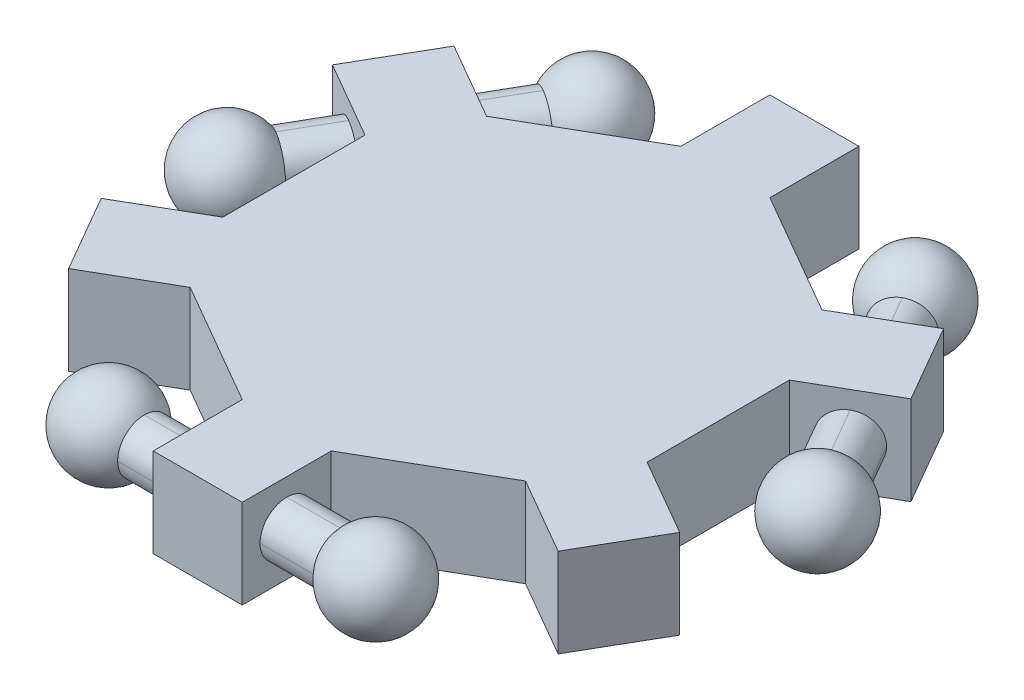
ISO-10303-21;
HEADER;
FILE_DESCRIPTION(('STEP AP214'),'2;1');
FILE_NAME('part.step','',(''),(''),'','','');
FILE_SCHEMA(('AUTOMOTIVE_DESIGN { 1 0 10303 214 1 1 1 1 }'));
ENDSEC;
DATA;
#1=APPLICATION_CONTEXT('core data for automotive mechanical design processes');
#2=APPLICATION_PROTOCOL_DEFINITION('international standard','automotive_design',2000,#1);
#3=PRODUCT_CONTEXT('',#1,'mechanical');
#4=PRODUCT('Part','Part','',(#3));
#5=PRODUCT_RELATED_PRODUCT_CATEGORY('part','',(#4));
#6=PRODUCT_DEFINITION_FORMATION('','',#4);
#7=PRODUCT_DEFINITION_CONTEXT('part definition',#1,'design');
#8=PRODUCT_DEFINITION('design','',#6,#7);
#9=PRODUCT_DEFINITION_SHAPE('','',#8);
#10=(LENGTH_UNIT() NAMED_UNIT(*) SI_UNIT(.MILLI.,.METRE.));
#11=(NAMED_UNIT(*) PLANE_ANGLE_UNIT() SI_UNIT($,.RADIAN.));
#12=(NAMED_UNIT(*) SI_UNIT($,.STERADIAN.) SOLID_ANGLE_UNIT());
#13=UNCERTAINTY_MEASURE_WITH_UNIT(LENGTH_MEASURE(1.E-05),#10,'distance_accuracy_value','');
#14=(GEOMETRIC_REPRESENTATION_CONTEXT(3) GLOBAL_UNCERTAINTY_ASSIGNED_CONTEXT((#13)) GLOBAL_UNIT_ASSIGNED_CONTEXT((#10,
#11,#12)) REPRESENTATION_CONTEXT('',''));
#15=CARTESIAN_POINT('',(0.,0.,0.));
#16=DIRECTION('',(0.,0.,1.));
#17=DIRECTION('',(1.,0.,0.));
#18=AXIS2_PLACEMENT_3D('',#15,#16,#17);
#19=CARTESIAN_POINT('',(163.499999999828,5.,-75.3589838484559));
#20=DIRECTION('',(-1.,0.,0.));
#21=DIRECTION('',(0.,0.,1.));
#22=AXIS2_PLACEMENT_3D('',#19,#20,#21);
#23=CYLINDRICAL_SURFACE('',#22,3.);
#24=DIRECTION('',(-1.,0.,0.));
#25=VECTOR('',#24,1.);
#26=CARTESIAN_POINT('',(163.499999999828,5.,-72.3589838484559));
#27=LINE('',#26,#25);
#28=CARTESIAN_POINT('',(159.499999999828,5.,-72.3589838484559));
#29=VERTEX_POINT('',#28);
#30=CARTESIAN_POINT('',(153.499999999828,5.,-72.3589838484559));
#31=VERTEX_POINT('',#30);
#32=EDGE_CURVE('E693',#29,#31,#27,.T.);
#33=ORIENTED_EDGE('',*,*,#32,.F.);
#34=CARTESIAN_POINT('',(159.499999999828,5.,-75.3589838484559));
#35=DIRECTION('',(1.,0.,0.));
#36=DIRECTION('',(0.,0.,-1.));
#37=AXIS2_PLACEMENT_3D('',#34,#35,#36);
#38=CIRCLE('',#37,3.);
#39=CARTESIAN_POINT('',(159.499999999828,8.,-75.3589838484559));
#40=VERTEX_POINT('',#39);
#41=EDGE_CURVE('E595',#29,#40,#38,.F.);
#42=ORIENTED_EDGE('',*,*,#41,.T.);
#43=DIRECTION('',(-1.,0.,0.));
#44=VECTOR('',#43,1.);
#45=CARTESIAN_POINT('',(163.499999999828,8.,-75.3589838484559));
#46=LINE('',#45,#44);
#47=CARTESIAN_POINT('',(153.499999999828,8.,-75.3589838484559));
#48=VERTEX_POINT('',#47);
#49=EDGE_CURVE('E865',#48,#40,#46,.F.);
#50=ORIENTED_EDGE('',*,*,#49,.F.);
#51=CARTESIAN_POINT('',(153.499999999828,5.,-75.3589838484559));
#52=DIRECTION('',(1.,0.,0.));
#53=DIRECTION('',(0.,0.,-1.));
#54=AXIS2_PLACEMENT_3D('',#51,#52,#53);
#55=CIRCLE('',#54,3.);
#56=EDGE_CURVE('E55',#31,#48,#55,.F.);
#57=ORIENTED_EDGE('',*,*,#56,.F.);
#58=EDGE_LOOP('',(#33,#42,#50,#57));
#59=FACE_BOUND('',#58,.T.);
#60=ADVANCED_FACE('F47',(#59),#23,.T.);
#61=CARTESIAN_POINT('',(163.499999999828,5.,-75.3589838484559));
#62=DIRECTION('',(-1.,0.,0.));
#63=DIRECTION('',(0.,0.,1.));
#64=AXIS2_PLACEMENT_3D('',#61,#62,#63);
#65=CYLINDRICAL_SURFACE('',#64,3.);
#66=DIRECTION('',(-1.,0.,0.));
#67=VECTOR('',#66,1.);
#68=CARTESIAN_POINT('',(163.499999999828,2.,-75.3589838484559));
#69=LINE('',#68,#67);
#70=CARTESIAN_POINT('',(159.499999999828,2.,-75.3589838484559));
#71=VERTEX_POINT('',#70);
#72=CARTESIAN_POINT('',(153.499999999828,2.,-75.3589838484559));
#73=VERTEX_POINT('',#72);
#74=EDGE_CURVE('E862',#71,#73,#69,.T.);
#75=ORIENTED_EDGE('',*,*,#74,.F.);
#76=CARTESIAN_POINT('',(159.499999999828,5.,-75.3589838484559));
#77=DIRECTION('',(1.,0.,0.));
#78=DIRECTION('',(0.,0.,-1.));
#79=AXIS2_PLACEMENT_3D('',#76,#77,#78);
#80=CIRCLE('',#79,3.);
#81=EDGE_CURVE('E591',#71,#29,#80,.F.);
#82=ORIENTED_EDGE('',*,*,#81,.T.);
#83=ORIENTED_EDGE('',*,*,#32,.T.);
#84=CARTESIAN_POINT('',(153.499999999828,5.,-75.3589838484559));
#85=DIRECTION('',(1.,0.,0.));
#86=DIRECTION('',(0.,0.,-1.));
#87=AXIS2_PLACEMENT_3D('',#84,#85,#86);
#88=CIRCLE('',#87,3.);
#89=EDGE_CURVE('E850',#73,#31,#88,.F.);
#90=ORIENTED_EDGE('',*,*,#89,.F.);
#91=EDGE_LOOP('',(#75,#82,#83,#90));
#92=FACE_BOUND('',#91,.T.);
#93=ADVANCED_FACE('F873',(#92),#65,.T.);
#94=CARTESIAN_POINT('',(163.499999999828,5.,-75.3589838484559));
#95=DIRECTION('',(-1.,0.,0.));
#96=DIRECTION('',(0.,0.,1.));
#97=AXIS2_PLACEMENT_3D('',#94,#95,#96);
#98=CYLINDRICAL_SURFACE('',#97,3.);
#99=ORIENTED_EDGE('',*,*,#49,.T.);
#100=CARTESIAN_POINT('',(159.499999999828,5.,-75.3589838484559));
#101=DIRECTION('',(1.,0.,0.));
#102=DIRECTION('',(0.,0.,-1.));
#103=AXIS2_PLACEMENT_3D('',#100,#101,#102);
#104=CIRCLE('',#103,3.);
#105=CARTESIAN_POINT('',(159.499999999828,5.,-78.3589838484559));
#106=VERTEX_POINT('',#105);
#107=EDGE_CURVE('E587',#40,#106,#104,.F.);
#108=ORIENTED_EDGE('',*,*,#107,.T.);
#109=DIRECTION('',(-1.,0.,0.));
#110=VECTOR('',#109,1.);
#111=CARTESIAN_POINT('',(163.499999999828,5.,-78.3589838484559));
#112=LINE('',#111,#110);
#113=CARTESIAN_POINT('',(153.499999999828,5.,-78.3589838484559));
#114=VERTEX_POINT('',#113);
#115=EDGE_CURVE('E599',#114,#106,#112,.F.);
#116=ORIENTED_EDGE('',*,*,#115,.F.);
#117=CARTESIAN_POINT('',(153.499999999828,5.,-75.3589838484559));
#118=DIRECTION('',(1.,0.,0.));
#119=DIRECTION('',(0.,0.,-1.));
#120=AXIS2_PLACEMENT_3D('',#117,#118,#119);
#121=CIRCLE('',#120,3.);
#122=EDGE_CURVE('E854',#48,#114,#121,.F.);
#123=ORIENTED_EDGE('',*,*,#122,.F.);
#124=EDGE_LOOP('',(#99,#108,#116,#123));
#125=FACE_BOUND('',#124,.T.);
#126=ADVANCED_FACE('F884',(#125),#98,.T.);
#127=CARTESIAN_POINT('',(163.499999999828,5.,-75.3589838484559));
#128=DIRECTION('',(-1.,0.,0.));
#129=DIRECTION('',(0.,0.,1.));
#130=AXIS2_PLACEMENT_3D('',#127,#128,#129);
#131=CYLINDRICAL_SURFACE('',#130,3.);
#132=ORIENTED_EDGE('',*,*,#115,.T.);
#133=CARTESIAN_POINT('',(159.499999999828,5.,-75.3589838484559));
#134=DIRECTION('',(1.,0.,0.));
#135=DIRECTION('',(0.,0.,-1.));
#136=AXIS2_PLACEMENT_3D('',#133,#134,#135);
#137=CIRCLE('',#136,3.);
#138=EDGE_CURVE('E11',#106,#71,#137,.F.);
#139=ORIENTED_EDGE('',*,*,#138,.T.);
#140=ORIENTED_EDGE('',*,*,#74,.T.);
#141=CARTESIAN_POINT('',(153.499999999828,5.,-75.3589838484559));
#142=DIRECTION('',(1.,0.,0.));
#143=DIRECTION('',(0.,0.,-1.));
#144=AXIS2_PLACEMENT_3D('',#141,#142,#143);
#145=CIRCLE('',#144,3.);
#146=EDGE_CURVE('E846',#114,#73,#145,.F.);
#147=ORIENTED_EDGE('',*,*,#146,.F.);
#148=EDGE_LOOP('',(#132,#139,#140,#147));
#149=FACE_BOUND('',#148,.T.);
#150=ADVANCED_FACE('F886',(#149),#131,.T.);
#151=CARTESIAN_POINT('',(153.499999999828,10.,0.));
#152=DIRECTION('',(1.,0.,0.));
#153=DIRECTION('',(0.,0.,-1.));
#154=AXIS2_PLACEMENT_3D('',#151,#152,#153);
#155=PLANE('',#154);
#156=ORIENTED_EDGE('',*,*,#89,.T.);
#157=ORIENTED_EDGE('',*,*,#56,.T.);
#158=ORIENTED_EDGE('',*,*,#122,.T.);
#159=ORIENTED_EDGE('',*,*,#146,.T.);
#160=EDGE_LOOP('',(#156,#157,#158,#159));
#161=FACE_BOUND('',#160,.T.);
#162=DIRECTION('',(0.,0.,1.));
#163=VECTOR('',#162,1.);
#164=CARTESIAN_POINT('',(153.499999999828,0.,0.));
#165=LINE('',#164,#163);
#166=CARTESIAN_POINT('',(153.499999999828,0.,-80.3589838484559));
#167=VERTEX_POINT('',#166);
#168=CARTESIAN_POINT('',(153.499999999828,0.,-70.3589838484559));
#169=VERTEX_POINT('',#168);
#170=EDGE_CURVE('E701',#167,#169,#165,.T.);
#171=ORIENTED_EDGE('',*,*,#170,.F.);
#172=DIRECTION('',(0.,-1.,0.));
#173=VECTOR('',#172,1.);
#174=CARTESIAN_POINT('',(153.499999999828,10.,-80.3589838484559));
#175=LINE('',#174,#173);
#176=CARTESIAN_POINT('',(153.499999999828,10.,-80.3589838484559));
#177=VERTEX_POINT('',#176);
#178=EDGE_CURVE('E833',#177,#167,#175,.T.);
#179=ORIENTED_EDGE('',*,*,#178,.F.);
#180=DIRECTION('',(0.,0.,1.));
#181=VECTOR('',#180,1.);
#182=CARTESIAN_POINT('',(153.499999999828,10.,0.));
#183=LINE('',#182,#181);
#184=CARTESIAN_POINT('',(153.499999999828,10.,-70.3589838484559));
#185=VERTEX_POINT('',#184);
#186=EDGE_CURVE('E612',#177,#185,#183,.T.);
#187=ORIENTED_EDGE('',*,*,#186,.T.);
#188=DIRECTION('',(0.,-1.,0.));
#189=VECTOR('',#188,1.);
#190=CARTESIAN_POINT('',(153.499999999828,10.,-70.3589838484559));
#191=LINE('',#190,#189);
#192=EDGE_CURVE('E836',#185,#169,#191,.T.);
#193=ORIENTED_EDGE('',*,*,#192,.T.);
#194=EDGE_LOOP('',(#171,#179,#187,#193));
#195=FACE_BOUND('',#194,.T.);
#196=ADVANCED_FACE('F877',(#161,#195),#155,.T.);
#197=CARTESIAN_POINT('',(70.6714607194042,10.,-122.406560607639));
#198=DIRECTION('',(0.500000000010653,0.,-0.866025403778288));
#199=DIRECTION('',(-0.866025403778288,0.,-0.500000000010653));
#200=AXIS2_PLACEMENT_3D('',#197,#198,#199);
#201=PLANE('',#200);
#202=DIRECTION('',(0.866025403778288,0.,0.500000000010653));
#203=VECTOR('',#202,1.);
#204=CARTESIAN_POINT('',(70.6714607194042,0.,-122.406560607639));
#205=LINE('',#204,#203);
#206=CARTESIAN_POINT('',(129.660254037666,0.,-88.3493649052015));
#207=VERTEX_POINT('',#206);
#208=CARTESIAN_POINT('',(143.499999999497,0.,-80.3589838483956));
#209=VERTEX_POINT('',#208);
#210=EDGE_CURVE('E688',#207,#209,#205,.T.);
#211=ORIENTED_EDGE('',*,*,#210,.T.);
#212=DIRECTION('',(0.,-1.,0.));
#213=VECTOR('',#212,1.);
#214=CARTESIAN_POINT('',(143.499999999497,10.,-80.3589838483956));
#215=LINE('',#214,#213);
#216=CARTESIAN_POINT('',(143.499999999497,10.,-80.3589838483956));
#217=VERTEX_POINT('',#216);
#218=EDGE_CURVE('E842',#217,#209,#215,.T.);
#219=ORIENTED_EDGE('',*,*,#218,.F.);
#220=DIRECTION('',(0.866025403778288,0.,0.500000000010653));
#221=VECTOR('',#220,1.);
#222=CARTESIAN_POINT('',(70.6714607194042,10.,-122.406560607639));
#223=LINE('',#222,#221);
#224=CARTESIAN_POINT('',(129.660254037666,10.,-88.3493649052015));
#225=VERTEX_POINT('',#224);
#226=EDGE_CURVE('E600',#225,#217,#223,.T.);
#227=ORIENTED_EDGE('',*,*,#226,.F.);
#228=DIRECTION('',(0.,-1.,0.));
#229=VECTOR('',#228,1.);
#230=CARTESIAN_POINT('',(129.660254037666,10.,-88.3493649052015));
#231=LINE('',#230,#229);
#232=EDGE_CURVE('E687',#225,#207,#231,.T.);
#233=ORIENTED_EDGE('',*,*,#232,.T.);
#234=EDGE_LOOP('',(#211,#219,#227,#233));
#235=FACE_BOUND('',#234,.T.);
#236=ADVANCED_FACE('F916',(#235),#201,.F.);
#237=CARTESIAN_POINT('',(143.499999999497,10.,0.));
#238=DIRECTION('',(1.,0.,0.));
#239=DIRECTION('',(0.,0.,-1.));
#240=AXIS2_PLACEMENT_3D('',#237,#238,#239);
#241=PLANE('',#240);
#242=CARTESIAN_POINT('',(143.50000000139,5.,-75.3589838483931));
#243=DIRECTION('',(1.,0.,-1.25621735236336E-11));
#244=DIRECTION('',(-1.25621735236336E-11,0.,-1.));
#245=AXIS2_PLACEMENT_3D('',#242,#243,#244);
#246=CIRCLE('',#245,3.);
#247=CARTESIAN_POINT('',(143.50000000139,8.,-75.3589838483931));
#248=VERTEX_POINT('',#247);
#249=CARTESIAN_POINT('',(143.499999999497,5.,-78.3589838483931));
#250=VERTEX_POINT('',#249);
#251=EDGE_CURVE('E563',#248,#250,#246,.F.);
#252=ORIENTED_EDGE('',*,*,#251,.F.);
#253=CARTESIAN_POINT('',(143.50000000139,5.,-75.3589838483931));
#254=DIRECTION('',(1.,0.,-1.25621735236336E-11));
#255=DIRECTION('',(-1.25621735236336E-11,0.,-1.));
#256=AXIS2_PLACEMENT_3D('',#253,#254,#255);
#257=CIRCLE('',#256,3.);
#258=CARTESIAN_POINT('',(143.500000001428,5.,-72.3589838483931));
#259=VERTEX_POINT('',#258);
#260=EDGE_CURVE('E566',#259,#248,#257,.F.);
#261=ORIENTED_EDGE('',*,*,#260,.F.);
#262=CARTESIAN_POINT('',(143.50000000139,5.,-75.3589838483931));
#263=DIRECTION('',(1.,0.,-1.25621735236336E-11));
#264=DIRECTION('',(-1.25621735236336E-11,0.,-1.));
#265=AXIS2_PLACEMENT_3D('',#262,#263,#264);
#266=CIRCLE('',#265,3.);
#267=CARTESIAN_POINT('',(143.50000000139,2.,-75.3589838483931));
#268=VERTEX_POINT('',#267);
#269=EDGE_CURVE('E560',#268,#259,#266,.F.);
#270=ORIENTED_EDGE('',*,*,#269,.F.);
#271=CARTESIAN_POINT('',(143.50000000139,5.,-75.3589838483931));
#272=DIRECTION('',(1.,0.,-1.25621735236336E-11));
#273=DIRECTION('',(-1.25621735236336E-11,0.,-1.));
#274=AXIS2_PLACEMENT_3D('',#271,#272,#273);
#275=CIRCLE('',#274,3.);
#276=EDGE_CURVE('E557',#250,#268,#275,.F.);
#277=ORIENTED_EDGE('',*,*,#276,.F.);
#278=EDGE_LOOP('',(#252,#261,#270,#277));
#279=FACE_BOUND('',#278,.T.);
#280=DIRECTION('',(0.,0.,1.));
#281=VECTOR('',#280,1.);
#282=CARTESIAN_POINT('',(143.499999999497,0.,0.));
#283=LINE('',#282,#281);
#284=CARTESIAN_POINT('',(143.499999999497,0.,-70.3589838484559));
#285=VERTEX_POINT('',#284);
#286=EDGE_CURVE('E692',#209,#285,#283,.T.);
#287=ORIENTED_EDGE('',*,*,#286,.T.);
#288=DIRECTION('',(0.,-1.,0.));
#289=VECTOR('',#288,1.);
#290=CARTESIAN_POINT('',(143.499999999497,10.,-70.3589838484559));
#291=LINE('',#290,#289);
#292=CARTESIAN_POINT('',(143.499999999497,10.,-70.3589838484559));
#293=VERTEX_POINT('',#292);
#294=EDGE_CURVE('E839',#293,#285,#291,.T.);
#295=ORIENTED_EDGE('',*,*,#294,.F.);
#296=DIRECTION('',(0.,0.,1.));
#297=VECTOR('',#296,1.);
#298=CARTESIAN_POINT('',(143.499999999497,10.,0.));
#299=LINE('',#298,#297);
#300=EDGE_CURVE('E604',#217,#293,#299,.T.);
#301=ORIENTED_EDGE('',*,*,#300,.F.);
#302=ORIENTED_EDGE('',*,*,#218,.T.);
#303=EDGE_LOOP('',(#287,#295,#301,#302));
#304=FACE_BOUND('',#303,.T.);
#305=ADVANCED_FACE('F919',(#279,#304),#241,.F.);
#306=CARTESIAN_POINT('',(0.,10.,-70.358983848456));
#307=DIRECTION('',(0.,0.,1.));
#308=DIRECTION('',(1.,0.,0.));
#309=AXIS2_PLACEMENT_3D('',#306,#307,#308);
#310=PLANE('',#309);
#311=DIRECTION('',(-1.,0.,0.));
#312=VECTOR('',#311,1.);
#313=CARTESIAN_POINT('',(0.,0.,-70.358983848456));
#314=LINE('',#313,#312);
#315=EDGE_CURVE('E697',#169,#285,#314,.T.);
#316=ORIENTED_EDGE('',*,*,#315,.F.);
#317=ORIENTED_EDGE('',*,*,#192,.F.);
#318=DIRECTION('',(-1.,0.,0.));
#319=VECTOR('',#318,1.);
#320=CARTESIAN_POINT('',(0.,10.,-70.358983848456));
#321=LINE('',#320,#319);
#322=EDGE_CURVE('E608',#185,#293,#321,.T.);
#323=ORIENTED_EDGE('',*,*,#322,.T.);
#324=ORIENTED_EDGE('',*,*,#294,.T.);
#325=EDGE_LOOP('',(#316,#317,#323,#324));
#326=FACE_BOUND('',#325,.T.);
#327=ADVANCED_FACE('F923',(#326),#310,.T.);
#328=CARTESIAN_POINT('',(3.57853928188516,10.,6.19821185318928));
#329=DIRECTION('',(0.49999999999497,0.,0.866025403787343));
#330=DIRECTION('',(0.866025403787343,0.,-0.49999999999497));
#331=AXIS2_PLACEMENT_3D('',#328,#329,#330);
#332=PLANE('',#331);
#333=DIRECTION('',(-0.866025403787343,0.,0.49999999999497));
#334=VECTOR('',#333,1.);
#335=CARTESIAN_POINT('',(3.57853928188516,0.,6.19821185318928));
#336=LINE('',#335,#334);
#337=CARTESIAN_POINT('',(167.339745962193,0.,-88.349364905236));
#338=VERTEX_POINT('',#337);
#339=EDGE_CURVE('E705',#338,#167,#336,.T.);
#340=ORIENTED_EDGE('',*,*,#339,.F.);
#341=DIRECTION('',(0.,-1.,0.));
#342=VECTOR('',#341,1.);
#343=CARTESIAN_POINT('',(167.339745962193,10.,-88.349364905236));
#344=LINE('',#343,#342);
#345=CARTESIAN_POINT('',(167.339745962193,10.,-88.349364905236));
#346=VERTEX_POINT('',#345);
#347=EDGE_CURVE('E830',#346,#338,#344,.T.);
#348=ORIENTED_EDGE('',*,*,#347,.F.);
#349=DIRECTION('',(-0.866025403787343,0.,0.49999999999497));
#350=VECTOR('',#349,1.);
#351=CARTESIAN_POINT('',(3.57853928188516,10.,6.19821185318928));
#352=LINE('',#351,#350);
#353=EDGE_CURVE('E616',#346,#177,#352,.T.);
#354=ORIENTED_EDGE('',*,*,#353,.T.);
#355=ORIENTED_EDGE('',*,*,#178,.T.);
#356=EDGE_LOOP('',(#340,#348,#354,#355));
#357=FACE_BOUND('',#356,.T.);
#358=ADVANCED_FACE('F927',(#357),#332,.T.);
#359=CARTESIAN_POINT('',(80.0913337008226,10.,-138.722259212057));
#360=DIRECTION('',(-0.50000000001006,0.,0.86602540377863));
#361=DIRECTION('',(0.86602540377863,0.,0.50000000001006));
#362=AXIS2_PLACEMENT_3D('',#359,#360,#361);
#363=PLANE('',#362);
#364=DIRECTION('',(-0.86602540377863,0.,-0.50000000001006));
#365=VECTOR('',#364,1.);
#366=CARTESIAN_POINT('',(80.0913337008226,0.,-138.722259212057));
#367=LINE('',#366,#365);
#368=CARTESIAN_POINT('',(175.999999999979,0.,-83.3493649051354));
#369=VERTEX_POINT('',#368);
#370=EDGE_CURVE('E709',#369,#338,#367,.T.);
#371=ORIENTED_EDGE('',*,*,#370,.F.);
#372=DIRECTION('',(0.,-1.,0.));
#373=VECTOR('',#372,1.);
#374=CARTESIAN_POINT('',(175.999999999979,10.,-83.3493649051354));
#375=LINE('',#374,#373);
#376=CARTESIAN_POINT('',(175.999999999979,10.,-83.3493649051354));
#377=VERTEX_POINT('',#376);
#378=EDGE_CURVE('E827',#377,#369,#375,.T.);
#379=ORIENTED_EDGE('',*,*,#378,.F.);
#380=DIRECTION('',(-0.86602540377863,0.,-0.50000000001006));
#381=VECTOR('',#380,1.);
#382=CARTESIAN_POINT('',(80.0913337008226,10.,-138.722259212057));
#383=LINE('',#382,#381);
#384=EDGE_CURVE('E620',#377,#346,#383,.T.);
#385=ORIENTED_EDGE('',*,*,#384,.T.);
#386=ORIENTED_EDGE('',*,*,#347,.T.);
#387=EDGE_LOOP('',(#371,#379,#385,#386));
#388=FACE_BOUND('',#387,.T.);
#389=ADVANCED_FACE('F933',(#388),#363,.T.);
#390=CARTESIAN_POINT('',(95.9086662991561,10.,55.3728943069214));
#391=DIRECTION('',(0.86602540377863,0.,0.500000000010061));
#392=DIRECTION('',(0.500000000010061,0.,-0.86602540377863));
#393=AXIS2_PLACEMENT_3D('',#390,#391,#392);
#394=PLANE('',#393);
#395=DIRECTION('',(-0.500000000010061,0.,0.86602540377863));
#396=VECTOR('',#395,1.);
#397=CARTESIAN_POINT('',(95.9086662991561,0.,55.3728943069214));
#398=LINE('',#397,#396);
#399=CARTESIAN_POINT('',(181.000000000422,0.,-92.0096189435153));
#400=VERTEX_POINT('',#399);
#401=EDGE_CURVE('E713',#400,#369,#398,.T.);
#402=ORIENTED_EDGE('',*,*,#401,.F.);
#403=DIRECTION('',(0.,-1.,0.));
#404=VECTOR('',#403,1.);
#405=CARTESIAN_POINT('',(181.000000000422,10.,-92.0096189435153));
#406=LINE('',#405,#404);
#407=CARTESIAN_POINT('',(181.000000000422,10.,-92.0096189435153));
#408=VERTEX_POINT('',#407);
#409=EDGE_CURVE('E824',#408,#400,#406,.T.);
#410=ORIENTED_EDGE('',*,*,#409,.F.);
#411=DIRECTION('',(-0.500000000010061,0.,0.86602540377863));
#412=VECTOR('',#411,1.);
#413=CARTESIAN_POINT('',(95.9086662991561,10.,55.3728943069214));
#414=LINE('',#413,#412);
#415=EDGE_CURVE('E624',#408,#377,#414,.T.);
#416=ORIENTED_EDGE('',*,*,#415,.T.);
#417=ORIENTED_EDGE('',*,*,#378,.T.);
#418=EDGE_LOOP('',(#402,#410,#416,#417));
#419=FACE_BOUND('',#418,.T.);
#420=ADVANCED_FACE('F937',(#419),#394,.T.);
#421=CARTESIAN_POINT('',(85.0913337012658,10.,-147.382513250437));
#422=DIRECTION('',(0.500000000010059,0.,-0.866025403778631));
#423=DIRECTION('',(-0.866025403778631,0.,-0.500000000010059));
#424=AXIS2_PLACEMENT_3D('',#421,#422,#423);
#425=PLANE('',#424);
#426=DIRECTION('',(0.866025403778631,0.,0.500000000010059));
#427=VECTOR('',#426,1.);
#428=CARTESIAN_POINT('',(85.0913337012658,0.,-147.382513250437));
#429=LINE('',#428,#427);
#430=CARTESIAN_POINT('',(172.339745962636,0.,-97.009618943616));
#431=VERTEX_POINT('',#430);
#432=EDGE_CURVE('E717',#431,#400,#429,.T.);
#433=ORIENTED_EDGE('',*,*,#432,.F.);
#434=DIRECTION('',(0.,-1.,0.));
#435=VECTOR('',#434,1.);
#436=CARTESIAN_POINT('',(172.339745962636,10.,-97.009618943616));
#437=LINE('',#436,#435);
#438=CARTESIAN_POINT('',(172.339745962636,10.,-97.009618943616));
#439=VERTEX_POINT('',#438);
#440=EDGE_CURVE('E821',#439,#431,#437,.T.);
#441=ORIENTED_EDGE('',*,*,#440,.F.);
#442=DIRECTION('',(0.866025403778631,0.,0.500000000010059));
#443=VECTOR('',#442,1.);
#444=CARTESIAN_POINT('',(85.0913337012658,10.,-147.382513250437));
#445=LINE('',#444,#443);
#446=EDGE_CURVE('E628',#439,#408,#445,.T.);
#447=ORIENTED_EDGE('',*,*,#446,.T.);
#448=ORIENTED_EDGE('',*,*,#409,.T.);
#449=EDGE_LOOP('',(#433,#441,#447,#448));
#450=FACE_BOUND('',#449,.T.);
#451=ADVANCED_FACE('F941',(#450),#425,.T.);
#452=CARTESIAN_POINT('',(172.339745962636,10.,2.99321697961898E-13));
#453=DIRECTION('',(1.,0.,0.));
#454=DIRECTION('',(0.,0.,-1.));
#455=AXIS2_PLACEMENT_3D('',#452,#453,#454);
#456=PLANE('',#455);
#457=DIRECTION('',(0.,0.,1.));
#458=VECTOR('',#457,1.);
#459=CARTESIAN_POINT('',(172.339745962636,0.,2.99321697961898E-13));
#460=LINE('',#459,#458);
#461=CARTESIAN_POINT('',(172.339745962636,0.,-112.990381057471));
#462=VERTEX_POINT('',#461);
#463=EDGE_CURVE('E721',#462,#431,#460,.T.);
#464=ORIENTED_EDGE('',*,*,#463,.F.);
#465=DIRECTION('',(0.,-1.,0.));
#466=VECTOR('',#465,1.);
#467=CARTESIAN_POINT('',(172.339745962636,10.,-112.990381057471));
#468=LINE('',#467,#466);
#469=CARTESIAN_POINT('',(172.339745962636,10.,-112.990381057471));
#470=VERTEX_POINT('',#469);
#471=EDGE_CURVE('E818',#470,#462,#468,.T.);
#472=ORIENTED_EDGE('',*,*,#471,.F.);
#473=DIRECTION('',(0.,0.,1.));
#474=VECTOR('',#473,1.);
#475=CARTESIAN_POINT('',(172.339745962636,10.,2.99321697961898E-13));
#476=LINE('',#475,#474);
#477=EDGE_CURVE('E632',#470,#439,#476,.T.);
#478=ORIENTED_EDGE('',*,*,#477,.T.);
#479=ORIENTED_EDGE('',*,*,#440,.T.);
#480=EDGE_LOOP('',(#464,#472,#478,#479));
#481=FACE_BOUND('',#480,.T.);
#482=ADVANCED_FACE('F945',(#481),#456,.T.);
#483=CARTESIAN_POINT('',(-5.84133369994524,10.,-10.1174867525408));
#484=DIRECTION('',(0.499999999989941,0.,0.866025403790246));
#485=DIRECTION('',(0.866025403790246,0.,-0.499999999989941));
#486=AXIS2_PLACEMENT_3D('',#483,#484,#485);
#487=PLANE('',#486);
#488=CARTESIAN_POINT('',(176.66987298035,5.,-115.490381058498));
#489=DIRECTION('',(-0.500000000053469,0.,-0.866025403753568));
#490=DIRECTION('',(-0.866025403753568,0.,0.500000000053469));
#491=AXIS2_PLACEMENT_3D('',#488,#489,#490);
#492=CIRCLE('',#491,3.);
#493=CARTESIAN_POINT('',(174.071796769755,5.,-113.990381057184));
#494=VERTEX_POINT('',#493);
#495=CARTESIAN_POINT('',(176.669872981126,2.,-115.490381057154));
#496=VERTEX_POINT('',#495);
#497=EDGE_CURVE('E62',#494,#496,#492,.F.);
#498=ORIENTED_EDGE('',*,*,#497,.F.);
#499=CARTESIAN_POINT('',(176.66987298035,5.,-115.490381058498));
#500=DIRECTION('',(-0.500000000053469,0.,-0.866025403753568));
#501=DIRECTION('',(-0.866025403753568,0.,0.500000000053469));
#502=AXIS2_PLACEMENT_3D('',#499,#500,#501);
#503=CIRCLE('',#502,3.);
#504=CARTESIAN_POINT('',(176.66987298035,8.,-115.490381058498));
#505=VERTEX_POINT('',#504);
#506=EDGE_CURVE('E358',#505,#494,#503,.F.);
#507=ORIENTED_EDGE('',*,*,#506,.F.);
#508=CARTESIAN_POINT('',(176.66987298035,5.,-115.490381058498));
#509=DIRECTION('',(-0.500000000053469,0.,-0.866025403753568));
#510=DIRECTION('',(-0.866025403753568,0.,0.500000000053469));
#511=AXIS2_PLACEMENT_3D('',#508,#509,#510);
#512=CIRCLE('',#511,3.);
#513=CARTESIAN_POINT('',(179.267949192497,5.,-116.990381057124));
#514=VERTEX_POINT('',#513);
#515=EDGE_CURVE('E372',#514,#505,#512,.F.);
#516=ORIENTED_EDGE('',*,*,#515,.F.);
#517=CARTESIAN_POINT('',(176.66987298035,5.,-115.490381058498));
#518=DIRECTION('',(-0.500000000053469,0.,-0.866025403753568));
#519=DIRECTION('',(-0.866025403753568,0.,0.500000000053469));
#520=AXIS2_PLACEMENT_3D('',#517,#518,#519);
#521=CIRCLE('',#520,3.);
#522=EDGE_CURVE('E67',#496,#514,#521,.F.);
#523=ORIENTED_EDGE('',*,*,#522,.F.);
#524=EDGE_LOOP('',(#498,#507,#516,#523));
#525=FACE_BOUND('',#524,.T.);
#526=DIRECTION('',(-0.866025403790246,0.,0.499999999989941));
#527=VECTOR('',#526,1.);
#528=CARTESIAN_POINT('',(-5.84133369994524,0.,-10.1174867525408));
#529=LINE('',#528,#527);
#530=CARTESIAN_POINT('',(181.000000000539,0.,-117.99038105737));
#531=VERTEX_POINT('',#530);
#532=EDGE_CURVE('E725',#531,#462,#529,.T.);
#533=ORIENTED_EDGE('',*,*,#532,.F.);
#534=DIRECTION('',(0.,-1.,0.));
#535=VECTOR('',#534,1.);
#536=CARTESIAN_POINT('',(181.000000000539,10.,-117.99038105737));
#537=LINE('',#536,#535);
#538=CARTESIAN_POINT('',(181.000000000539,10.,-117.99038105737));
#539=VERTEX_POINT('',#538);
#540=EDGE_CURVE('E815',#539,#531,#537,.T.);
#541=ORIENTED_EDGE('',*,*,#540,.F.);
#542=DIRECTION('',(-0.866025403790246,0.,0.499999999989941));
#543=VECTOR('',#542,1.);
#544=CARTESIAN_POINT('',(-5.84133369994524,10.,-10.1174867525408));
#545=LINE('',#544,#543);
#546=EDGE_CURVE('E636',#539,#470,#545,.T.);
#547=ORIENTED_EDGE('',*,*,#546,.T.);
#548=ORIENTED_EDGE('',*,*,#471,.T.);
#549=EDGE_LOOP('',(#533,#541,#547,#548));
#550=FACE_BOUND('',#549,.T.);
#551=ADVANCED_FACE('F949',(#525,#550),#487,.T.);
#552=CARTESIAN_POINT('',(186.841333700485,10.,-107.872894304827));
#553=DIRECTION('',(0.866025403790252,0.,-0.499999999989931));
#554=DIRECTION('',(-0.499999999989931,0.,-0.866025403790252));
#555=AXIS2_PLACEMENT_3D('',#552,#553,#554);
#556=PLANE('',#555);
#557=DIRECTION('',(0.499999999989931,0.,0.866025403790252));
#558=VECTOR('',#557,1.);
#559=CARTESIAN_POINT('',(186.841333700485,0.,-107.872894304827));
#560=LINE('',#559,#558);
#561=CARTESIAN_POINT('',(176.000000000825,0.,-126.650635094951));
#562=VERTEX_POINT('',#561);
#563=EDGE_CURVE('E729',#562,#531,#560,.T.);
#564=ORIENTED_EDGE('',*,*,#563,.F.);
#565=DIRECTION('',(0.,-1.,0.));
#566=VECTOR('',#565,1.);
#567=CARTESIAN_POINT('',(176.000000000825,10.,-126.650635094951));
#568=LINE('',#567,#566);
#569=CARTESIAN_POINT('',(176.000000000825,10.,-126.650635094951));
#570=VERTEX_POINT('',#569);
#571=EDGE_CURVE('E812',#570,#562,#568,.T.);
#572=ORIENTED_EDGE('',*,*,#571,.F.);
#573=DIRECTION('',(0.499999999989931,0.,0.866025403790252));
#574=VECTOR('',#573,1.);
#575=CARTESIAN_POINT('',(186.841333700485,10.,-107.872894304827));
#576=LINE('',#575,#574);
#577=EDGE_CURVE('E640',#570,#539,#576,.T.);
#578=ORIENTED_EDGE('',*,*,#577,.T.);
#579=ORIENTED_EDGE('',*,*,#540,.T.);
#580=EDGE_LOOP('',(#564,#572,#578,#579));
#581=FACE_BOUND('',#580,.T.);
#582=ADVANCED_FACE('F953',(#581),#556,.T.);
#583=CARTESIAN_POINT('',(-10.8413336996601,10.,-18.7777407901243));
#584=DIRECTION('',(-0.49999999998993,0.,-0.866025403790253));
#585=DIRECTION('',(-0.866025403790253,0.,0.49999999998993));
#586=AXIS2_PLACEMENT_3D('',#583,#584,#585);
#587=PLANE('',#586);
#588=CARTESIAN_POINT('',(171.669872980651,5.,-124.150635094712));
#589=DIRECTION('',(-0.50000000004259,0.,-0.866025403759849));
#590=DIRECTION('',(-0.866025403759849,0.,0.50000000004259));
#591=AXIS2_PLACEMENT_3D('',#588,#589,#590);
#592=CIRCLE('',#591,3.);
#593=CARTESIAN_POINT('',(174.267949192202,5.,-125.650635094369));
#594=VERTEX_POINT('',#593);
#595=CARTESIAN_POINT('',(171.669872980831,8.,-124.1506350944));
#596=VERTEX_POINT('',#595);
#597=EDGE_CURVE('E423',#594,#596,#592,.F.);
#598=ORIENTED_EDGE('',*,*,#597,.T.);
#599=CARTESIAN_POINT('',(171.669872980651,5.,-124.150635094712));
#600=DIRECTION('',(-0.50000000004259,0.,-0.866025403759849));
#601=DIRECTION('',(-0.866025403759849,0.,0.50000000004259));
#602=AXIS2_PLACEMENT_3D('',#599,#600,#601);
#603=CIRCLE('',#602,3.);
#604=CARTESIAN_POINT('',(169.071796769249,5.,-122.650635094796));
#605=VERTEX_POINT('',#604);
#606=EDGE_CURVE('E420',#596,#605,#603,.F.);
#607=ORIENTED_EDGE('',*,*,#606,.T.);
#608=CARTESIAN_POINT('',(171.669872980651,5.,-124.150635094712));
#609=DIRECTION('',(-0.50000000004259,0.,-0.866025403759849));
#610=DIRECTION('',(-0.866025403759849,0.,0.50000000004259));
#611=AXIS2_PLACEMENT_3D('',#608,#609,#610);
#612=CIRCLE('',#611,3.);
#613=CARTESIAN_POINT('',(171.669872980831,2.,-124.1506350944));
#614=VERTEX_POINT('',#613);
#615=EDGE_CURVE('E413',#605,#614,#612,.F.);
#616=ORIENTED_EDGE('',*,*,#615,.T.);
#617=CARTESIAN_POINT('',(171.669872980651,5.,-124.150635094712));
#618=DIRECTION('',(-0.50000000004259,0.,-0.866025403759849));
#619=DIRECTION('',(-0.866025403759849,0.,0.50000000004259));
#620=AXIS2_PLACEMENT_3D('',#617,#618,#619);
#621=CIRCLE('',#620,3.);
#622=EDGE_CURVE('E416',#614,#594,#621,.F.);
#623=ORIENTED_EDGE('',*,*,#622,.T.);
#624=EDGE_LOOP('',(#598,#607,#616,#623));
#625=FACE_BOUND('',#624,.T.);
#626=DIRECTION('',(0.866025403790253,0.,-0.49999999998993));
#627=VECTOR('',#626,1.);
#628=CARTESIAN_POINT('',(-10.8413336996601,0.,-18.7777407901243));
#629=LINE('',#628,#627);
#630=CARTESIAN_POINT('',(167.339745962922,0.,-121.650635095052));
#631=VERTEX_POINT('',#630);
#632=EDGE_CURVE('E733',#631,#562,#629,.T.);
#633=ORIENTED_EDGE('',*,*,#632,.F.);
#634=DIRECTION('',(0.,-1.,0.));
#635=VECTOR('',#634,1.);
#636=CARTESIAN_POINT('',(167.339745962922,10.,-121.650635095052));
#637=LINE('',#636,#635);
#638=CARTESIAN_POINT('',(167.339745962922,10.,-121.650635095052));
#639=VERTEX_POINT('',#638);
#640=EDGE_CURVE('E809',#639,#631,#637,.T.);
#641=ORIENTED_EDGE('',*,*,#640,.F.);
#642=DIRECTION('',(0.866025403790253,0.,-0.49999999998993));
#643=VECTOR('',#642,1.);
#644=CARTESIAN_POINT('',(-10.8413336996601,10.,-18.7777407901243));
#645=LINE('',#644,#643);
#646=EDGE_CURVE('E644',#639,#570,#645,.T.);
#647=ORIENTED_EDGE('',*,*,#646,.T.);
#648=ORIENTED_EDGE('',*,*,#571,.T.);
#649=EDGE_LOOP('',(#633,#641,#647,#648));
#650=FACE_BOUND('',#649,.T.);
#651=ADVANCED_FACE('F956',(#625,#650),#587,.T.);
#652=CARTESIAN_POINT('',(94.5112066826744,10.,-163.698211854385));
#653=DIRECTION('',(0.500000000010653,0.,-0.866025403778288));
#654=DIRECTION('',(-0.866025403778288,0.,-0.500000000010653));
#655=AXIS2_PLACEMENT_3D('',#652,#653,#654);
#656=PLANE('',#655);
#657=DIRECTION('',(0.866025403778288,0.,0.500000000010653));
#658=VECTOR('',#657,1.);
#659=CARTESIAN_POINT('',(94.5112066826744,0.,-163.698211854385));
#660=LINE('',#659,#658);
#661=CARTESIAN_POINT('',(153.500000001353,0.,-129.641016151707));
#662=VERTEX_POINT('',#661);
#663=EDGE_CURVE('E737',#662,#631,#660,.T.);
#664=ORIENTED_EDGE('',*,*,#663,.F.);
#665=DIRECTION('',(0.,-1.,0.));
#666=VECTOR('',#665,1.);
#667=CARTESIAN_POINT('',(153.500000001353,10.,-129.641016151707));
#668=LINE('',#667,#666);
#669=CARTESIAN_POINT('',(153.500000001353,10.,-129.641016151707));
#670=VERTEX_POINT('',#669);
#671=EDGE_CURVE('E806',#670,#662,#668,.T.);
#672=ORIENTED_EDGE('',*,*,#671,.F.);
#673=DIRECTION('',(0.866025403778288,0.,0.500000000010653));
#674=VECTOR('',#673,1.);
#675=CARTESIAN_POINT('',(94.5112066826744,10.,-163.698211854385));
#676=LINE('',#675,#674);
#677=EDGE_CURVE('E648',#670,#639,#676,.T.);
#678=ORIENTED_EDGE('',*,*,#677,.T.);
#679=ORIENTED_EDGE('',*,*,#640,.T.);
#680=EDGE_LOOP('',(#664,#672,#678,#679));
#681=FACE_BOUND('',#680,.T.);
#682=ADVANCED_FACE('F960',(#681),#656,.T.);
#683=CARTESIAN_POINT('',(153.500000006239,10.,-5.78573300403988E-09));
#684=DIRECTION('',(1.,0.,-3.76920716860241E-11));
#685=DIRECTION('',(-3.76920716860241E-11,0.,-1.));
#686=AXIS2_PLACEMENT_3D('',#683,#684,#685);
#687=PLANE('',#686);
#688=DIRECTION('',(3.76920716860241E-11,0.,1.));
#689=VECTOR('',#688,1.);
#690=CARTESIAN_POINT('',(153.500000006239,0.,-5.78573300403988E-09));
#691=LINE('',#690,#689);
#692=CARTESIAN_POINT('',(153.500000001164,0.,-139.641016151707));
#693=VERTEX_POINT('',#692);
#694=EDGE_CURVE('E741',#693,#662,#691,.T.);
#695=ORIENTED_EDGE('',*,*,#694,.F.);
#696=DIRECTION('',(0.,-1.,0.));
#697=VECTOR('',#696,1.);
#698=CARTESIAN_POINT('',(153.500000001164,10.,-139.641016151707));
#699=LINE('',#698,#697);
#700=CARTESIAN_POINT('',(153.500000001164,10.,-139.641016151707));
#701=VERTEX_POINT('',#700);
#702=EDGE_CURVE('E803',#701,#693,#699,.T.);
#703=ORIENTED_EDGE('',*,*,#702,.F.);
#704=DIRECTION('',(3.76920716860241E-11,0.,1.));
#705=VECTOR('',#704,1.);
#706=CARTESIAN_POINT('',(153.500000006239,10.,-5.78573300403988E-09));
#707=LINE('',#706,#705);
#708=EDGE_CURVE('E652',#701,#670,#707,.T.);
#709=ORIENTED_EDGE('',*,*,#708,.T.);
#710=ORIENTED_EDGE('',*,*,#671,.T.);
#711=EDGE_LOOP('',(#695,#703,#709,#710));
#712=FACE_BOUND('',#711,.T.);
#713=ADVANCED_FACE('F964',(#712),#687,.T.);
#714=CARTESIAN_POINT('',(-9.10720048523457E-10,10.,-139.641016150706));
#715=DIRECTION('',(-6.52186638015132E-12,0.,-1.));
#716=DIRECTION('',(-1.,0.,6.52186638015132E-12));
#717=AXIS2_PLACEMENT_3D('',#714,#715,#716);
#718=PLANE('',#717);
#719=DIRECTION('',(1.,0.,-6.52186638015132E-12));
#720=VECTOR('',#719,1.);
#721=CARTESIAN_POINT('',(-9.10720048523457E-10,0.,-139.641016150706));
#722=LINE('',#721,#720);
#723=CARTESIAN_POINT('',(143.500000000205,0.,-139.641016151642));
#724=VERTEX_POINT('',#723);
#725=EDGE_CURVE('E745',#724,#693,#722,.T.);
#726=ORIENTED_EDGE('',*,*,#725,.F.);
#727=DIRECTION('',(0.,-1.,0.));
#728=VECTOR('',#727,1.);
#729=CARTESIAN_POINT('',(143.500000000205,10.,-139.641016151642));
#730=LINE('',#729,#728);
#731=CARTESIAN_POINT('',(143.500000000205,10.,-139.641016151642));
#732=VERTEX_POINT('',#731);
#733=EDGE_CURVE('E800',#732,#724,#730,.T.);
#734=ORIENTED_EDGE('',*,*,#733,.F.);
#735=DIRECTION('',(1.,0.,-6.52186638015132E-12));
#736=VECTOR('',#735,1.);
#737=CARTESIAN_POINT('',(-9.10720048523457E-10,10.,-139.641016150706));
#738=LINE('',#737,#736);
#739=EDGE_CURVE('E656',#732,#701,#738,.T.);
#740=ORIENTED_EDGE('',*,*,#739,.T.);
#741=ORIENTED_EDGE('',*,*,#702,.T.);
#742=EDGE_LOOP('',(#726,#734,#740,#741));
#743=FACE_BOUND('',#742,.T.);
#744=ADVANCED_FACE('F968',(#743),#718,.T.);
#745=CARTESIAN_POINT('',(143.500000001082,10.,-9.35589106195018E-10));
#746=DIRECTION('',(1.,0.,-6.51978471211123E-12));
#747=DIRECTION('',(-6.51978471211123E-12,0.,-1.));
#748=AXIS2_PLACEMENT_3D('',#745,#746,#747);
#749=PLANE('',#748);
#750=DIRECTION('',(6.51978471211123E-12,0.,1.));
#751=VECTOR('',#750,1.);
#752=CARTESIAN_POINT('',(143.500000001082,0.,-9.35589106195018E-10));
#753=LINE('',#752,#751);
#754=CARTESIAN_POINT('',(143.500000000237,0.,-129.641016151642));
#755=VERTEX_POINT('',#754);
#756=EDGE_CURVE('E749',#724,#755,#753,.T.);
#757=ORIENTED_EDGE('',*,*,#756,.T.);
#758=DIRECTION('',(0.,-1.,0.));
#759=VECTOR('',#758,1.);
#760=CARTESIAN_POINT('',(143.500000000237,10.,-129.641016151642));
#761=LINE('',#760,#759);
#762=CARTESIAN_POINT('',(143.500000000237,10.,-129.641016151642));
#763=VERTEX_POINT('',#762);
#764=EDGE_CURVE('E796',#763,#755,#761,.T.);
#765=ORIENTED_EDGE('',*,*,#764,.F.);
#766=DIRECTION('',(6.51978471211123E-12,0.,1.));
#767=VECTOR('',#766,1.);
#768=CARTESIAN_POINT('',(143.500000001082,10.,-9.35589106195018E-10));
#769=LINE('',#768,#767);
#770=EDGE_CURVE('E660',#732,#763,#769,.T.);
#771=ORIENTED_EDGE('',*,*,#770,.F.);
#772=ORIENTED_EDGE('',*,*,#733,.T.);
#773=EDGE_LOOP('',(#757,#765,#771,#772));
#774=FACE_BOUND('',#773,.T.);
#775=ADVANCED_FACE('F972',(#774),#749,.F.);
#776=CARTESIAN_POINT('',(-20.2612066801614,10.,-35.0934393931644));
#777=DIRECTION('',(0.499999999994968,0.,0.866025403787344));
#778=DIRECTION('',(0.866025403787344,0.,-0.499999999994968));
#779=AXIS2_PLACEMENT_3D('',#776,#777,#778);
#780=PLANE('',#779);
#781=DIRECTION('',(-0.866025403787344,0.,0.499999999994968));
#782=VECTOR('',#781,1.);
#783=CARTESIAN_POINT('',(-20.2612066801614,0.,-35.0934393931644));
#784=LINE('',#783,#782);
#785=CARTESIAN_POINT('',(129.660254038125,0.,-121.650635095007));
#786=VERTEX_POINT('',#785);
#787=EDGE_CURVE('E752',#755,#786,#784,.T.);
#788=ORIENTED_EDGE('',*,*,#787,.T.);
#789=DIRECTION('',(0.,-1.,0.));
#790=VECTOR('',#789,1.);
#791=CARTESIAN_POINT('',(129.660254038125,10.,-121.650635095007));
#792=LINE('',#791,#790);
#793=CARTESIAN_POINT('',(129.660254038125,10.,-121.650635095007));
#794=VERTEX_POINT('',#793);
#795=EDGE_CURVE('E792',#794,#786,#792,.T.);
#796=ORIENTED_EDGE('',*,*,#795,.F.);
#797=DIRECTION('',(-0.866025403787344,0.,0.499999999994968));
#798=VECTOR('',#797,1.);
#799=CARTESIAN_POINT('',(-20.2612066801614,10.,-35.0934393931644));
#800=LINE('',#799,#798);
#801=EDGE_CURVE('E663',#763,#794,#800,.T.);
#802=ORIENTED_EDGE('',*,*,#801,.F.);
#803=ORIENTED_EDGE('',*,*,#764,.T.);
#804=EDGE_LOOP('',(#788,#796,#802,#803));
#805=FACE_BOUND('',#804,.T.);
#806=ADVANCED_FACE('F976',(#805),#780,.F.);
#807=CARTESIAN_POINT('',(85.0913336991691,10.,-147.382513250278));
#808=DIRECTION('',(-0.500000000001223,0.,0.866025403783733));
#809=DIRECTION('',(0.866025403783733,0.,0.500000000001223));
#810=AXIS2_PLACEMENT_3D('',#807,#808,#809);
#811=PLANE('',#810);
#812=CARTESIAN_POINT('',(125.330127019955,5.,-124.150635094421));
#813=DIRECTION('',(-0.500000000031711,0.,0.86602540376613));
#814=DIRECTION('',(0.86602540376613,0.,0.500000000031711));
#815=AXIS2_PLACEMENT_3D('',#812,#813,#814);
#816=CIRCLE('',#815,3.);
#817=CARTESIAN_POINT('',(125.330127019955,8.,-124.150635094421));
#818=VERTEX_POINT('',#817);
#819=CARTESIAN_POINT('',(127.928203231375,5.,-122.650635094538));
#820=VERTEX_POINT('',#819);
#821=EDGE_CURVE('E507',#818,#820,#816,.F.);
#822=ORIENTED_EDGE('',*,*,#821,.F.);
#823=CARTESIAN_POINT('',(125.330127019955,5.,-124.150635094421));
#824=DIRECTION('',(-0.500000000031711,0.,0.86602540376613));
#825=DIRECTION('',(0.86602540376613,0.,0.500000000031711));
#826=AXIS2_PLACEMENT_3D('',#823,#824,#825);
#827=CIRCLE('',#826,3.);
#828=CARTESIAN_POINT('',(122.732050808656,5.,-125.650635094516));
#829=VERTEX_POINT('',#828);
#830=EDGE_CURVE('E510',#829,#818,#827,.F.);
#831=ORIENTED_EDGE('',*,*,#830,.F.);
#832=CARTESIAN_POINT('',(125.330127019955,5.,-124.150635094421));
#833=DIRECTION('',(-0.500000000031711,0.,0.86602540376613));
#834=DIRECTION('',(0.86602540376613,0.,0.500000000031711));
#835=AXIS2_PLACEMENT_3D('',#832,#833,#834);
#836=CIRCLE('',#835,3.);
#837=CARTESIAN_POINT('',(125.330127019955,2.,-124.150635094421));
#838=VERTEX_POINT('',#837);
#839=EDGE_CURVE('E503',#838,#829,#836,.F.);
#840=ORIENTED_EDGE('',*,*,#839,.F.);
#841=CARTESIAN_POINT('',(125.330127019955,5.,-124.150635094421));
#842=DIRECTION('',(-0.500000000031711,0.,0.86602540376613));
#843=DIRECTION('',(0.86602540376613,0.,0.500000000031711));
#844=AXIS2_PLACEMENT_3D('',#841,#842,#843);
#845=CIRCLE('',#844,3.);
#846=EDGE_CURVE('E500',#820,#838,#845,.F.);
#847=ORIENTED_EDGE('',*,*,#846,.F.);
#848=EDGE_LOOP('',(#822,#831,#840,#847));
#849=FACE_BOUND('',#848,.T.);
#850=DIRECTION('',(-0.866025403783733,0.,-0.500000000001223));
#851=VECTOR('',#850,1.);
#852=CARTESIAN_POINT('',(85.0913336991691,0.,-147.382513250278));
#853=LINE('',#852,#851);
#854=CARTESIAN_POINT('',(121.000000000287,0.,-126.65063509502));
#855=VERTEX_POINT('',#854);
#856=EDGE_CURVE('E755',#786,#855,#853,.T.);
#857=ORIENTED_EDGE('',*,*,#856,.T.);
#858=DIRECTION('',(0.,-1.,0.));
#859=VECTOR('',#858,1.);
#860=CARTESIAN_POINT('',(121.000000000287,10.,-126.65063509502));
#861=LINE('',#860,#859);
#862=CARTESIAN_POINT('',(121.000000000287,10.,-126.65063509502));
#863=VERTEX_POINT('',#862);
#864=EDGE_CURVE('E789',#863,#855,#861,.T.);
#865=ORIENTED_EDGE('',*,*,#864,.F.);
#866=DIRECTION('',(-0.866025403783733,0.,-0.500000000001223));
#867=VECTOR('',#866,1.);
#868=CARTESIAN_POINT('',(85.0913336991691,10.,-147.382513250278));
#869=LINE('',#868,#867);
#870=EDGE_CURVE('E666',#794,#863,#869,.T.);
#871=ORIENTED_EDGE('',*,*,#870,.F.);
#872=ORIENTED_EDGE('',*,*,#795,.T.);
#873=EDGE_LOOP('',(#857,#865,#871,#872));
#874=FACE_BOUND('',#873,.T.);
#875=ADVANCED_FACE('F980',(#849,#874),#811,.F.);
#876=CARTESIAN_POINT('',(35.9086663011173,10.,20.7318781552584));
#877=DIRECTION('',(-0.86602540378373,0.,-0.500000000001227));
#878=DIRECTION('',(-0.500000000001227,0.,0.866025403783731));
#879=AXIS2_PLACEMENT_3D('',#876,#877,#878);
#880=PLANE('',#879);
#881=DIRECTION('',(0.500000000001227,0.,-0.866025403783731));
#882=VECTOR('',#881,1.);
#883=CARTESIAN_POINT('',(35.9086663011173,0.,20.7318781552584));
#884=LINE('',#883,#882);
#885=CARTESIAN_POINT('',(116.000000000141,0.,-117.990381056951));
#886=VERTEX_POINT('',#885);
#887=EDGE_CURVE('E759',#886,#855,#884,.T.);
#888=ORIENTED_EDGE('',*,*,#887,.F.);
#889=DIRECTION('',(0.,-1.,0.));
#890=VECTOR('',#889,1.);
#891=CARTESIAN_POINT('',(116.000000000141,10.,-117.990381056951));
#892=LINE('',#891,#890);
#893=CARTESIAN_POINT('',(116.000000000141,10.,-117.990381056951));
#894=VERTEX_POINT('',#893);
#895=EDGE_CURVE('E786',#894,#886,#892,.T.);
#896=ORIENTED_EDGE('',*,*,#895,.F.);
#897=DIRECTION('',(0.500000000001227,0.,-0.866025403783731));
#898=VECTOR('',#897,1.);
#899=CARTESIAN_POINT('',(35.9086663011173,10.,20.7318781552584));
#900=LINE('',#899,#898);
#901=EDGE_CURVE('E669',#894,#863,#900,.T.);
#902=ORIENTED_EDGE('',*,*,#901,.T.);
#903=ORIENTED_EDGE('',*,*,#864,.T.);
#904=EDGE_LOOP('',(#888,#896,#902,#903));
#905=FACE_BOUND('',#904,.T.);
#906=ADVANCED_FACE('F984',(#905),#880,.T.);
#907=CARTESIAN_POINT('',(80.091333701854,10.,-138.722259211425));
#908=DIRECTION('',(0.500000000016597,0.,-0.866025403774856));
#909=DIRECTION('',(-0.866025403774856,0.,-0.500000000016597));
#910=AXIS2_PLACEMENT_3D('',#907,#908,#909);
#911=PLANE('',#910);
#912=CARTESIAN_POINT('',(120.330127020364,5.,-115.490381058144));
#913=DIRECTION('',(-0.50000000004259,0.,0.866025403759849));
#914=DIRECTION('',(0.866025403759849,0.,0.50000000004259));
#915=AXIS2_PLACEMENT_3D('',#912,#913,#914);
#916=CIRCLE('',#915,3.);
#917=CARTESIAN_POINT('',(120.330127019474,2.,-115.490381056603));
#918=VERTEX_POINT('',#917);
#919=CARTESIAN_POINT('',(117.732050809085,5.,-116.990381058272));
#920=VERTEX_POINT('',#919);
#921=EDGE_CURVE('E459',#918,#920,#916,.F.);
#922=ORIENTED_EDGE('',*,*,#921,.T.);
#923=CARTESIAN_POINT('',(120.330127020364,5.,-115.490381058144));
#924=DIRECTION('',(-0.50000000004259,0.,0.866025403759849));
#925=DIRECTION('',(0.866025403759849,0.,0.50000000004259));
#926=AXIS2_PLACEMENT_3D('',#923,#924,#925);
#927=CIRCLE('',#926,3.);
#928=CARTESIAN_POINT('',(120.330127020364,8.,-115.490381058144));
#929=VERTEX_POINT('',#928);
#930=EDGE_CURVE('E468',#920,#929,#927,.F.);
#931=ORIENTED_EDGE('',*,*,#930,.T.);
#932=CARTESIAN_POINT('',(120.330127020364,5.,-115.490381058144));
#933=DIRECTION('',(-0.50000000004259,0.,0.866025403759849));
#934=DIRECTION('',(0.866025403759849,0.,0.50000000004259));
#935=AXIS2_PLACEMENT_3D('',#932,#933,#934);
#936=CIRCLE('',#935,3.);
#937=CARTESIAN_POINT('',(122.928203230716,5.,-113.99038105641));
#938=VERTEX_POINT('',#937);
#939=EDGE_CURVE('E464',#929,#938,#936,.F.);
#940=ORIENTED_EDGE('',*,*,#939,.T.);
#941=CARTESIAN_POINT('',(120.330127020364,5.,-115.490381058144));
#942=DIRECTION('',(-0.50000000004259,0.,0.866025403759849));
#943=DIRECTION('',(0.866025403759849,0.,0.50000000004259));
#944=AXIS2_PLACEMENT_3D('',#941,#942,#943);
#945=CIRCLE('',#944,3.);
#946=EDGE_CURVE('E455',#938,#918,#945,.F.);
#947=ORIENTED_EDGE('',*,*,#946,.T.);
#948=EDGE_LOOP('',(#922,#931,#940,#947));
#949=FACE_BOUND('',#948,.T.);
#950=DIRECTION('',(0.866025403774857,0.,0.500000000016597));
#951=VECTOR('',#950,1.);
#952=CARTESIAN_POINT('',(80.091333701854,0.,-138.722259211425));
#953=LINE('',#952,#951);
#954=CARTESIAN_POINT('',(124.66025403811,0.,-112.990381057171));
#955=VERTEX_POINT('',#954);
#956=EDGE_CURVE('E763',#886,#955,#953,.T.);
#957=ORIENTED_EDGE('',*,*,#956,.T.);
#958=DIRECTION('',(0.,-1.,0.));
#959=VECTOR('',#958,1.);
#960=CARTESIAN_POINT('',(124.66025403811,10.,-112.990381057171));
#961=LINE('',#960,#959);
#962=CARTESIAN_POINT('',(124.66025403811,10.,-112.990381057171));
#963=VERTEX_POINT('',#962);
#964=EDGE_CURVE('E546',#963,#955,#961,.T.);
#965=ORIENTED_EDGE('',*,*,#964,.F.);
#966=DIRECTION('',(0.866025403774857,0.,0.500000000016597));
#967=VECTOR('',#966,1.);
#968=CARTESIAN_POINT('',(80.091333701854,10.,-138.722259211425));
#969=LINE('',#968,#967);
#970=EDGE_CURVE('E673',#894,#963,#969,.T.);
#971=ORIENTED_EDGE('',*,*,#970,.F.);
#972=ORIENTED_EDGE('',*,*,#895,.T.);
#973=EDGE_LOOP('',(#957,#965,#971,#972));
#974=FACE_BOUND('',#973,.T.);
#975=ADVANCED_FACE('F988',(#949,#974),#911,.F.);
#976=CARTESIAN_POINT('',(-10.8413336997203,10.,-18.7777407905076));
#977=DIRECTION('',(0.499999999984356,0.,0.866025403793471));
#978=DIRECTION('',(0.866025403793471,0.,-0.499999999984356));
#979=AXIS2_PLACEMENT_3D('',#976,#977,#978);
#980=PLANE('',#979);
#981=DIRECTION('',(-0.866025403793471,0.,0.499999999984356));
#982=VECTOR('',#981,1.);
#983=CARTESIAN_POINT('',(-10.8413336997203,0.,-18.7777407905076));
#984=LINE('',#983,#982);
#985=CARTESIAN_POINT('',(124.660254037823,0.,-97.0096189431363));
#986=VERTEX_POINT('',#985);
#987=CARTESIAN_POINT('',(115.999999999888,0.,-92.0096189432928));
#988=VERTEX_POINT('',#987);
#989=EDGE_CURVE('E767',#986,#988,#984,.T.);
#990=ORIENTED_EDGE('',*,*,#989,.T.);
#991=DIRECTION('',(0.,-1.,0.));
#992=VECTOR('',#991,1.);
#993=CARTESIAN_POINT('',(115.999999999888,10.,-92.0096189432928));
#994=LINE('',#993,#992);
#995=CARTESIAN_POINT('',(115.999999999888,10.,-92.0096189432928));
#996=VERTEX_POINT('',#995);
#997=EDGE_CURVE('E783',#996,#988,#994,.T.);
#998=ORIENTED_EDGE('',*,*,#997,.F.);
#999=DIRECTION('',(-0.866025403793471,0.,0.499999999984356));
#1000=VECTOR('',#999,1.);
#1001=CARTESIAN_POINT('',(-10.8413336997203,10.,-18.7777407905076));
#1002=LINE('',#1001,#1000);
#1003=CARTESIAN_POINT('',(124.66025403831,10.,-97.0096189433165));
#1004=VERTEX_POINT('',#1003);
#1005=EDGE_CURVE('E677',#1004,#996,#1002,.T.);
#1006=ORIENTED_EDGE('',*,*,#1005,.F.);
#1007=DIRECTION('',(0.,-1.,0.));
#1008=VECTOR('',#1007,1.);
#1009=CARTESIAN_POINT('',(124.66025403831,10.,-97.0096189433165));
#1010=LINE('',#1009,#1008);
#1011=EDGE_CURVE('E553',#1004,#986,#1010,.T.);
#1012=ORIENTED_EDGE('',*,*,#1011,.T.);
#1013=EDGE_LOOP('',(#990,#998,#1006,#1012));
#1014=FACE_BOUND('',#1013,.T.);
#1015=ADVANCED_FACE('F992',(#1014),#980,.F.);
#1016=CARTESIAN_POINT('',(126.841333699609,10.,-73.2318781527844));
#1017=DIRECTION('',(-0.866025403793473,0.,0.499999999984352));
#1018=DIRECTION('',(0.499999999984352,0.,0.866025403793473));
#1019=AXIS2_PLACEMENT_3D('',#1016,#1017,#1018);
#1020=PLANE('',#1019);
#1021=DIRECTION('',(-0.499999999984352,0.,-0.866025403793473));
#1022=VECTOR('',#1021,1.);
#1023=CARTESIAN_POINT('',(126.841333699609,0.,-73.2318781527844));
#1024=LINE('',#1023,#1022);
#1025=CARTESIAN_POINT('',(120.999999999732,0.,-83.349364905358));
#1026=VERTEX_POINT('',#1025);
#1027=EDGE_CURVE('E771',#1026,#988,#1024,.T.);
#1028=ORIENTED_EDGE('',*,*,#1027,.F.);
#1029=DIRECTION('',(0.,-1.,0.));
#1030=VECTOR('',#1029,1.);
#1031=CARTESIAN_POINT('',(120.999999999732,10.,-83.349364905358));
#1032=LINE('',#1031,#1030);
#1033=CARTESIAN_POINT('',(120.999999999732,10.,-83.349364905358));
#1034=VERTEX_POINT('',#1033);
#1035=EDGE_CURVE('E780',#1034,#1026,#1032,.T.);
#1036=ORIENTED_EDGE('',*,*,#1035,.F.);
#1037=DIRECTION('',(-0.499999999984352,0.,-0.866025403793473));
#1038=VECTOR('',#1037,1.);
#1039=CARTESIAN_POINT('',(126.841333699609,10.,-73.2318781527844));
#1040=LINE('',#1039,#1038);
#1041=EDGE_CURVE('E680',#1034,#996,#1040,.T.);
#1042=ORIENTED_EDGE('',*,*,#1041,.T.);
#1043=ORIENTED_EDGE('',*,*,#997,.T.);
#1044=EDGE_LOOP('',(#1028,#1036,#1042,#1043));
#1045=FACE_BOUND('',#1044,.T.);
#1046=ADVANCED_FACE('F996',(#1045),#1020,.T.);
#1047=CARTESIAN_POINT('',(-5.84133369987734,10.,-10.1174867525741));
#1048=DIRECTION('',(-0.499999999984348,0.,-0.866025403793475));
#1049=DIRECTION('',(-0.866025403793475,0.,0.499999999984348));
#1050=AXIS2_PLACEMENT_3D('',#1047,#1048,#1049);
#1051=PLANE('',#1050);
#1052=DIRECTION('',(0.866025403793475,0.,-0.499999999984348));
#1053=VECTOR('',#1052,1.);
#1054=CARTESIAN_POINT('',(-5.84133369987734,0.,-10.1174867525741));
#1055=LINE('',#1054,#1053);
#1056=EDGE_CURVE('E605',#1026,#207,#1055,.T.);
#1057=ORIENTED_EDGE('',*,*,#1056,.T.);
#1058=ORIENTED_EDGE('',*,*,#232,.F.);
#1059=DIRECTION('',(0.866025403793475,0.,-0.499999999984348));
#1060=VECTOR('',#1059,1.);
#1061=CARTESIAN_POINT('',(-5.84133369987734,10.,-10.1174867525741));
#1062=LINE('',#1061,#1060);
#1063=EDGE_CURVE('E684',#1034,#225,#1062,.T.);
#1064=ORIENTED_EDGE('',*,*,#1063,.F.);
#1065=ORIENTED_EDGE('',*,*,#1035,.T.);
#1066=EDGE_LOOP('',(#1057,#1058,#1064,#1065));
#1067=FACE_BOUND('',#1066,.T.);
#1068=ADVANCED_FACE('F1000',(#1067),#1051,.F.);
#1069=CARTESIAN_POINT('',(0.,10.,0.));
#1070=DIRECTION('',(0.,1.,0.));
#1071=DIRECTION('',(0.,0.,1.));
#1072=AXIS2_PLACEMENT_3D('',#1069,#1070,#1071);
#1073=PLANE('',#1072);
#1074=ORIENTED_EDGE('',*,*,#477,.F.);
#1075=ORIENTED_EDGE('',*,*,#546,.F.);
#1076=ORIENTED_EDGE('',*,*,#577,.F.);
#1077=ORIENTED_EDGE('',*,*,#646,.F.);
#1078=ORIENTED_EDGE('',*,*,#677,.F.);
#1079=ORIENTED_EDGE('',*,*,#708,.F.);
#1080=ORIENTED_EDGE('',*,*,#739,.F.);
#1081=ORIENTED_EDGE('',*,*,#770,.T.);
#1082=ORIENTED_EDGE('',*,*,#801,.T.);
#1083=ORIENTED_EDGE('',*,*,#870,.T.);
#1084=ORIENTED_EDGE('',*,*,#901,.F.);
#1085=ORIENTED_EDGE('',*,*,#970,.T.);
#1086=DIRECTION('',(1.25639103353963E-11,0.,1.));
#1087=VECTOR('',#1086,1.);
#1088=CARTESIAN_POINT('',(124.660254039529,10.,2.99778347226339E-10));
#1089=LINE('',#1088,#1087);
#1090=EDGE_CURVE('E543',#963,#1004,#1089,.T.);
#1091=ORIENTED_EDGE('',*,*,#1090,.T.);
#1092=ORIENTED_EDGE('',*,*,#1005,.T.);
#1093=ORIENTED_EDGE('',*,*,#1041,.F.);
#1094=ORIENTED_EDGE('',*,*,#1063,.T.);
#1095=ORIENTED_EDGE('',*,*,#226,.T.);
#1096=ORIENTED_EDGE('',*,*,#300,.T.);
#1097=ORIENTED_EDGE('',*,*,#322,.F.);
#1098=ORIENTED_EDGE('',*,*,#186,.F.);
#1099=ORIENTED_EDGE('',*,*,#353,.F.);
#1100=ORIENTED_EDGE('',*,*,#384,.F.);
#1101=ORIENTED_EDGE('',*,*,#415,.F.);
#1102=ORIENTED_EDGE('',*,*,#446,.F.);
#1103=EDGE_LOOP('',(#1074,#1075,#1076,#1077,#1078,#1079,#1080,#1081,#1082,#1083,#1084,#1085,
#1091,#1092,#1093,#1094,#1095,#1096,#1097,#1098,#1099,#1100,#1101,#1102));
#1104=FACE_BOUND('',#1103,.T.);
#1105=ADVANCED_FACE('F900',(#1104),#1073,.T.);
#1106=CARTESIAN_POINT('',(0.,0.,0.));
#1107=DIRECTION('',(0.,1.,0.));
#1108=DIRECTION('',(0.,0.,1.));
#1109=AXIS2_PLACEMENT_3D('',#1106,#1107,#1108);
#1110=PLANE('',#1109);
#1111=ORIENTED_EDGE('',*,*,#532,.T.);
#1112=ORIENTED_EDGE('',*,*,#463,.T.);
#1113=ORIENTED_EDGE('',*,*,#432,.T.);
#1114=ORIENTED_EDGE('',*,*,#401,.T.);
#1115=ORIENTED_EDGE('',*,*,#370,.T.);
#1116=ORIENTED_EDGE('',*,*,#339,.T.);
#1117=ORIENTED_EDGE('',*,*,#170,.T.);
#1118=ORIENTED_EDGE('',*,*,#315,.T.);
#1119=ORIENTED_EDGE('',*,*,#286,.F.);
#1120=ORIENTED_EDGE('',*,*,#210,.F.);
#1121=ORIENTED_EDGE('',*,*,#1056,.F.);
#1122=ORIENTED_EDGE('',*,*,#1027,.T.);
#1123=ORIENTED_EDGE('',*,*,#989,.F.);
#1124=DIRECTION('',(1.25639103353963E-11,0.,1.));
#1125=VECTOR('',#1124,1.);
#1126=CARTESIAN_POINT('',(124.660254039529,0.,2.99778347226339E-10));
#1127=LINE('',#1126,#1125);
#1128=EDGE_CURVE('E547',#955,#986,#1127,.T.);
#1129=ORIENTED_EDGE('',*,*,#1128,.F.);
#1130=ORIENTED_EDGE('',*,*,#956,.F.);
#1131=ORIENTED_EDGE('',*,*,#887,.T.);
#1132=ORIENTED_EDGE('',*,*,#856,.F.);
#1133=ORIENTED_EDGE('',*,*,#787,.F.);
#1134=ORIENTED_EDGE('',*,*,#756,.F.);
#1135=ORIENTED_EDGE('',*,*,#725,.T.);
#1136=ORIENTED_EDGE('',*,*,#694,.T.);
#1137=ORIENTED_EDGE('',*,*,#663,.T.);
#1138=ORIENTED_EDGE('',*,*,#632,.T.);
#1139=ORIENTED_EDGE('',*,*,#563,.T.);
#1140=EDGE_LOOP('',(#1111,#1112,#1113,#1114,#1115,#1116,#1117,#1118,#1119,#1120,#1121,#1122,
#1123,#1129,#1130,#1131,#1132,#1133,#1134,#1135,#1136,#1137,#1138,#1139));
#1141=FACE_BOUND('',#1140,.T.);
#1142=ADVANCED_FACE('F891',(#1141),#1110,.F.);
#1143=CARTESIAN_POINT('',(163.499999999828,5.,-75.3589838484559));
#1144=DIRECTION('',(0.,0.,1.));
#1145=DIRECTION('',(0.,1.,0.));
#1146=AXIS2_PLACEMENT_3D('',#1143,#1144,#1145);
#1147=SPHERICAL_SURFACE('',#1146,5.);
#1148=CARTESIAN_POINT('',(163.499999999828,5.,-75.3589838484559));
#1149=DIRECTION('',(1.,0.,0.));
#1150=DIRECTION('',(0.,0.,-1.));
#1151=AXIS2_PLACEMENT_3D('',#1148,#1149,#1150);
#1152=SPHERICAL_SURFACE('',#1151,5.);
#1153=ORIENTED_EDGE('',*,*,#41,.F.);
#1154=ORIENTED_EDGE('',*,*,#81,.F.);
#1155=ORIENTED_EDGE('',*,*,#138,.F.);
#1156=ORIENTED_EDGE('',*,*,#107,.F.);
#1157=EDGE_LOOP('',(#1153,#1154,#1155,#1156));
#1158=FACE_BOUND('',#1157,.T.);
#1159=ADVANCED_FACE('F888',(#1158),#1152,.T.);
#1160=CARTESIAN_POINT('',(124.660254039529,10.,2.99778347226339E-10));
#1161=DIRECTION('',(-1.,0.,1.25639103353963E-11));
#1162=DIRECTION('',(-1.25639103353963E-11,0.,-1.));
#1163=AXIS2_PLACEMENT_3D('',#1160,#1161,#1162);
#1164=PLANE('',#1163);
#1165=ORIENTED_EDGE('',*,*,#1128,.T.);
#1166=ORIENTED_EDGE('',*,*,#1011,.F.);
#1167=ORIENTED_EDGE('',*,*,#1090,.F.);
#1168=ORIENTED_EDGE('',*,*,#964,.T.);
#1169=EDGE_LOOP('',(#1165,#1166,#1167,#1168));
#1170=FACE_BOUND('',#1169,.T.);
#1171=ADVANCED_FACE('F890',(#1170),#1164,.T.);
#1172=CARTESIAN_POINT('',(133.50000000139,5.,-75.3589838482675));
#1173=DIRECTION('',(1.,0.,-1.25621735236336E-11));
#1174=DIRECTION('',(1.25621735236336E-11,0.,1.));
#1175=AXIS2_PLACEMENT_3D('',#1172,#1173,#1174);
#1176=CYLINDRICAL_SURFACE('',#1175,3.);
#1177=DIRECTION('',(1.,0.,-1.25621735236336E-11));
#1178=VECTOR('',#1177,1.);
#1179=CARTESIAN_POINT('',(133.500000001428,5.,-72.3589838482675));
#1180=LINE('',#1179,#1178);
#1181=CARTESIAN_POINT('',(137.500000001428,5.,-72.3589838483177));
#1182=VERTEX_POINT('',#1181);
#1183=EDGE_CURVE('E550',#1182,#259,#1180,.T.);
#1184=ORIENTED_EDGE('',*,*,#1183,.T.);
#1185=ORIENTED_EDGE('',*,*,#260,.T.);
#1186=DIRECTION('',(1.,0.,-1.25621735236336E-11));
#1187=VECTOR('',#1186,1.);
#1188=CARTESIAN_POINT('',(133.50000000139,8.,-75.3589838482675));
#1189=LINE('',#1188,#1187);
#1190=CARTESIAN_POINT('',(137.50000000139,8.,-75.3589838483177));
#1191=VERTEX_POINT('',#1190);
#1192=EDGE_CURVE('E578',#248,#1191,#1189,.F.);
#1193=ORIENTED_EDGE('',*,*,#1192,.T.);
#1194=CARTESIAN_POINT('',(137.50000000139,5.,-75.3589838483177));
#1195=DIRECTION('',(1.,0.,-1.25621735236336E-11));
#1196=DIRECTION('',(-1.25621735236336E-11,0.,-1.));
#1197=AXIS2_PLACEMENT_3D('',#1194,#1195,#1196);
#1198=CIRCLE('',#1197,3.);
#1199=EDGE_CURVE('E538',#1182,#1191,#1198,.F.);
#1200=ORIENTED_EDGE('',*,*,#1199,.F.);
#1201=EDGE_LOOP('',(#1184,#1185,#1193,#1200));
#1202=FACE_BOUND('',#1201,.T.);
#1203=ADVANCED_FACE('F897',(#1202),#1176,.T.);
#1204=CARTESIAN_POINT('',(133.50000000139,5.,-75.3589838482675));
#1205=DIRECTION('',(1.,0.,-1.25621735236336E-11));
#1206=DIRECTION('',(1.25621735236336E-11,0.,1.));
#1207=AXIS2_PLACEMENT_3D('',#1204,#1205,#1206);
#1208=CYLINDRICAL_SURFACE('',#1207,3.);
#1209=DIRECTION('',(1.,0.,-1.25621735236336E-11));
#1210=VECTOR('',#1209,1.);
#1211=CARTESIAN_POINT('',(133.50000000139,2.,-75.3589838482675));
#1212=LINE('',#1211,#1210);
#1213=CARTESIAN_POINT('',(137.50000000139,2.,-75.3589838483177));
#1214=VERTEX_POINT('',#1213);
#1215=EDGE_CURVE('E574',#1214,#268,#1212,.T.);
#1216=ORIENTED_EDGE('',*,*,#1215,.T.);
#1217=ORIENTED_EDGE('',*,*,#269,.T.);
#1218=ORIENTED_EDGE('',*,*,#1183,.F.);
#1219=CARTESIAN_POINT('',(137.50000000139,5.,-75.3589838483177));
#1220=DIRECTION('',(1.,0.,-1.25621735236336E-11));
#1221=DIRECTION('',(-1.25621735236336E-11,0.,-1.));
#1222=AXIS2_PLACEMENT_3D('',#1219,#1220,#1221);
#1223=CIRCLE('',#1222,3.);
#1224=EDGE_CURVE('E535',#1214,#1182,#1223,.F.);
#1225=ORIENTED_EDGE('',*,*,#1224,.F.);
#1226=EDGE_LOOP('',(#1216,#1217,#1218,#1225));
#1227=FACE_BOUND('',#1226,.T.);
#1228=ADVANCED_FACE('F1238',(#1227),#1208,.T.);
#1229=CARTESIAN_POINT('',(133.50000000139,5.,-75.3589838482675));
#1230=DIRECTION('',(1.,0.,-1.25621735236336E-11));
#1231=DIRECTION('',(1.25621735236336E-11,0.,1.));
#1232=AXIS2_PLACEMENT_3D('',#1229,#1230,#1231);
#1233=CYLINDRICAL_SURFACE('',#1232,3.);
#1234=ORIENTED_EDGE('',*,*,#1192,.F.);
#1235=ORIENTED_EDGE('',*,*,#251,.T.);
#1236=DIRECTION('',(1.,0.,-1.25621735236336E-11));
#1237=VECTOR('',#1236,1.);
#1238=CARTESIAN_POINT('',(133.500000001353,5.,-78.3589838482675));
#1239=LINE('',#1238,#1237);
#1240=CARTESIAN_POINT('',(137.500000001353,5.,-78.3589838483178));
#1241=VERTEX_POINT('',#1240);
#1242=EDGE_CURVE('E542',#250,#1241,#1239,.F.);
#1243=ORIENTED_EDGE('',*,*,#1242,.T.);
#1244=CARTESIAN_POINT('',(137.50000000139,5.,-75.3589838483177));
#1245=DIRECTION('',(1.,0.,-1.25621735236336E-11));
#1246=DIRECTION('',(-1.25621735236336E-11,0.,-1.));
#1247=AXIS2_PLACEMENT_3D('',#1244,#1245,#1246);
#1248=CIRCLE('',#1247,3.);
#1249=EDGE_CURVE('E531',#1191,#1241,#1248,.F.);
#1250=ORIENTED_EDGE('',*,*,#1249,.F.);
#1251=EDGE_LOOP('',(#1234,#1235,#1243,#1250));
#1252=FACE_BOUND('',#1251,.T.);
#1253=ADVANCED_FACE('F1243',(#1252),#1233,.T.);
#1254=CARTESIAN_POINT('',(133.50000000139,5.,-75.3589838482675));
#1255=DIRECTION('',(1.,0.,-1.25621735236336E-11));
#1256=DIRECTION('',(1.25621735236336E-11,0.,1.));
#1257=AXIS2_PLACEMENT_3D('',#1254,#1255,#1256);
#1258=CYLINDRICAL_SURFACE('',#1257,3.);
#1259=ORIENTED_EDGE('',*,*,#1242,.F.);
#1260=ORIENTED_EDGE('',*,*,#276,.T.);
#1261=ORIENTED_EDGE('',*,*,#1215,.F.);
#1262=CARTESIAN_POINT('',(137.50000000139,5.,-75.3589838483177));
#1263=DIRECTION('',(1.,0.,-1.25621735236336E-11));
#1264=DIRECTION('',(-1.25621735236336E-11,0.,-1.));
#1265=AXIS2_PLACEMENT_3D('',#1262,#1263,#1264);
#1266=CIRCLE('',#1265,3.);
#1267=EDGE_CURVE('E570',#1241,#1214,#1266,.F.);
#1268=ORIENTED_EDGE('',*,*,#1267,.F.);
#1269=EDGE_LOOP('',(#1259,#1260,#1261,#1268));
#1270=FACE_BOUND('',#1269,.T.);
#1271=ADVANCED_FACE('F1254',(#1270),#1258,.T.);
#1272=CARTESIAN_POINT('',(133.50000000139,5.,-75.3589838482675));
#1273=DIRECTION('',(1.25621735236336E-11,0.,1.));
#1274=DIRECTION('',(0.,1.,0.));
#1275=AXIS2_PLACEMENT_3D('',#1272,#1273,#1274);
#1276=SPHERICAL_SURFACE('',#1275,5.);
#1277=CARTESIAN_POINT('',(133.50000000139,5.,-75.3589838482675));
#1278=DIRECTION('',(1.,0.,-1.25621735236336E-11));
#1279=DIRECTION('',(-1.25621735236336E-11,0.,-1.));
#1280=AXIS2_PLACEMENT_3D('',#1277,#1278,#1279);
#1281=SPHERICAL_SURFACE('',#1280,5.);
#1282=ORIENTED_EDGE('',*,*,#1199,.T.);
#1283=ORIENTED_EDGE('',*,*,#1249,.T.);
#1284=ORIENTED_EDGE('',*,*,#1267,.T.);
#1285=ORIENTED_EDGE('',*,*,#1224,.T.);
#1286=EDGE_LOOP('',(#1282,#1283,#1284,#1285));
#1287=FACE_BOUND('',#1286,.T.);
#1288=ADVANCED_FACE('F1274',(#1287),#1281,.T.);
#1289=CARTESIAN_POINT('',(115.330127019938,5.,-106.830127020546));
#1290=DIRECTION('',(-0.866025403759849,0.,-0.50000000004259));
#1291=DIRECTION('',(0.,1.,0.));
#1292=AXIS2_PLACEMENT_3D('',#1289,#1290,#1291);
#1293=SPHERICAL_SURFACE('',#1292,5.);
#1294=CARTESIAN_POINT('',(115.330127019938,5.,-106.830127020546));
#1295=DIRECTION('',(-0.50000000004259,0.,0.866025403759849));
#1296=DIRECTION('',(0.866025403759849,0.,0.50000000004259));
#1297=AXIS2_PLACEMENT_3D('',#1294,#1295,#1296);
#1298=SPHERICAL_SURFACE('',#1297,5.);
#1299=CARTESIAN_POINT('',(117.330127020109,5.,-110.294228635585));
#1300=DIRECTION('',(-0.50000000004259,0.,0.866025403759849));
#1301=DIRECTION('',(0.866025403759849,0.,0.50000000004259));
#1302=AXIS2_PLACEMENT_3D('',#1299,#1300,#1301);
#1303=CIRCLE('',#1302,3.);
#1304=CARTESIAN_POINT('',(114.732050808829,5.,-111.794228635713));
#1305=VERTEX_POINT('',#1304);
#1306=CARTESIAN_POINT('',(117.330127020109,8.,-110.294228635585));
#1307=VERTEX_POINT('',#1306);
#1308=EDGE_CURVE('E450',#1305,#1307,#1303,.F.);
#1309=ORIENTED_EDGE('',*,*,#1308,.F.);
#1310=CARTESIAN_POINT('',(117.330127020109,5.,-110.294228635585));
#1311=DIRECTION('',(-0.50000000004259,0.,0.866025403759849));
#1312=DIRECTION('',(0.866025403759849,0.,0.50000000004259));
#1313=AXIS2_PLACEMENT_3D('',#1310,#1311,#1312);
#1314=CIRCLE('',#1313,3.);
#1315=CARTESIAN_POINT('',(117.330127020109,2.,-110.294228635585));
#1316=VERTEX_POINT('',#1315);
#1317=EDGE_CURVE('E447',#1316,#1305,#1314,.F.);
#1318=ORIENTED_EDGE('',*,*,#1317,.F.);
#1319=CARTESIAN_POINT('',(117.330127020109,5.,-110.294228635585));
#1320=DIRECTION('',(-0.50000000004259,0.,0.866025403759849));
#1321=DIRECTION('',(0.866025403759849,0.,0.50000000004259));
#1322=AXIS2_PLACEMENT_3D('',#1319,#1320,#1321);
#1323=CIRCLE('',#1322,3.);
#1324=CARTESIAN_POINT('',(119.928203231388,5.,-108.794228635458));
#1325=VERTEX_POINT('',#1324);
#1326=EDGE_CURVE('E472',#1325,#1316,#1323,.F.);
#1327=ORIENTED_EDGE('',*,*,#1326,.F.);
#1328=CARTESIAN_POINT('',(117.330127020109,5.,-110.294228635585));
#1329=DIRECTION('',(-0.50000000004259,0.,0.866025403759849));
#1330=DIRECTION('',(0.866025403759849,0.,0.50000000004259));
#1331=AXIS2_PLACEMENT_3D('',#1328,#1329,#1330);
#1332=CIRCLE('',#1331,3.);
#1333=EDGE_CURVE('E443',#1307,#1325,#1332,.F.);
#1334=ORIENTED_EDGE('',*,*,#1333,.F.);
#1335=EDGE_LOOP('',(#1309,#1318,#1327,#1334));
#1336=FACE_BOUND('',#1335,.T.);
#1337=ADVANCED_FACE('F1285',(#1336),#1298,.T.);
#1338=CARTESIAN_POINT('',(115.330127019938,5.,-106.830127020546));
#1339=DIRECTION('',(0.50000000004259,0.,-0.866025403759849));
#1340=DIRECTION('',(-0.866025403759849,0.,-0.50000000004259));
#1341=AXIS2_PLACEMENT_3D('',#1338,#1339,#1340);
#1342=CYLINDRICAL_SURFACE('',#1341,3.);
#1343=DIRECTION('',(0.50000000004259,0.,-0.866025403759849));
#1344=VECTOR('',#1343,1.);
#1345=CARTESIAN_POINT('',(117.928203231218,5.,-105.330127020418));
#1346=LINE('',#1345,#1344);
#1347=EDGE_CURVE('E454',#938,#1325,#1346,.F.);
#1348=ORIENTED_EDGE('',*,*,#1347,.T.);
#1349=ORIENTED_EDGE('',*,*,#1326,.T.);
#1350=DIRECTION('',(0.50000000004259,0.,-0.866025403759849));
#1351=VECTOR('',#1350,1.);
#1352=CARTESIAN_POINT('',(115.330127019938,2.,-106.830127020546));
#1353=LINE('',#1352,#1351);
#1354=EDGE_CURVE('E476',#1316,#918,#1353,.T.);
#1355=ORIENTED_EDGE('',*,*,#1354,.T.);
#1356=ORIENTED_EDGE('',*,*,#946,.F.);
#1357=EDGE_LOOP('',(#1348,#1349,#1355,#1356));
#1358=FACE_BOUND('',#1357,.T.);
#1359=ADVANCED_FACE('F1296',(#1358),#1342,.T.);
#1360=CARTESIAN_POINT('',(115.330127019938,5.,-106.830127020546));
#1361=DIRECTION('',(0.50000000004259,0.,-0.866025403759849));
#1362=DIRECTION('',(-0.866025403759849,0.,-0.50000000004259));
#1363=AXIS2_PLACEMENT_3D('',#1360,#1361,#1362);
#1364=CYLINDRICAL_SURFACE('',#1363,3.);
#1365=DIRECTION('',(0.50000000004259,0.,-0.866025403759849));
#1366=VECTOR('',#1365,1.);
#1367=CARTESIAN_POINT('',(115.330127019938,8.,-106.830127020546));
#1368=LINE('',#1367,#1366);
#1369=EDGE_CURVE('E480',#929,#1307,#1368,.F.);
#1370=ORIENTED_EDGE('',*,*,#1369,.T.);
#1371=ORIENTED_EDGE('',*,*,#1333,.T.);
#1372=ORIENTED_EDGE('',*,*,#1347,.F.);
#1373=ORIENTED_EDGE('',*,*,#939,.F.);
#1374=EDGE_LOOP('',(#1370,#1371,#1372,#1373));
#1375=FACE_BOUND('',#1374,.T.);
#1376=ADVANCED_FACE('F1307',(#1375),#1364,.T.);
#1377=CARTESIAN_POINT('',(115.330127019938,5.,-106.830127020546));
#1378=DIRECTION('',(0.50000000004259,0.,-0.866025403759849));
#1379=DIRECTION('',(-0.866025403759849,0.,-0.50000000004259));
#1380=AXIS2_PLACEMENT_3D('',#1377,#1378,#1379);
#1381=CYLINDRICAL_SURFACE('',#1380,3.);
#1382=ORIENTED_EDGE('',*,*,#1354,.F.);
#1383=ORIENTED_EDGE('',*,*,#1317,.T.);
#1384=DIRECTION('',(0.50000000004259,0.,-0.866025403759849));
#1385=VECTOR('',#1384,1.);
#1386=CARTESIAN_POINT('',(112.732050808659,5.,-108.330127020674));
#1387=LINE('',#1386,#1385);
#1388=EDGE_CURVE('E460',#1305,#920,#1387,.T.);
#1389=ORIENTED_EDGE('',*,*,#1388,.T.);
#1390=ORIENTED_EDGE('',*,*,#921,.F.);
#1391=EDGE_LOOP('',(#1382,#1383,#1389,#1390));
#1392=FACE_BOUND('',#1391,.T.);
#1393=ADVANCED_FACE('F1318',(#1392),#1381,.T.);
#1394=CARTESIAN_POINT('',(115.330127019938,5.,-106.830127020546));
#1395=DIRECTION('',(0.50000000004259,0.,-0.866025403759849));
#1396=DIRECTION('',(-0.866025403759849,0.,-0.50000000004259));
#1397=AXIS2_PLACEMENT_3D('',#1394,#1395,#1396);
#1398=CYLINDRICAL_SURFACE('',#1397,3.);
#1399=ORIENTED_EDGE('',*,*,#1388,.F.);
#1400=ORIENTED_EDGE('',*,*,#1308,.T.);
#1401=ORIENTED_EDGE('',*,*,#1369,.F.);
#1402=ORIENTED_EDGE('',*,*,#930,.F.);
#1403=EDGE_LOOP('',(#1399,#1400,#1401,#1402));
#1404=FACE_BOUND('',#1403,.T.);
#1405=ADVANCED_FACE('F1329',(#1404),#1398,.T.);
#1406=CARTESIAN_POINT('',(130.330127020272,5.,-132.810889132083));
#1407=DIRECTION('',(-0.500000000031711,0.,0.86602540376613));
#1408=DIRECTION('',(-0.86602540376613,0.,-0.500000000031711));
#1409=AXIS2_PLACEMENT_3D('',#1406,#1407,#1408);
#1410=CYLINDRICAL_SURFACE('',#1409,3.);
#1411=DIRECTION('',(-0.500000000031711,0.,0.86602540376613));
#1412=VECTOR('',#1411,1.);
#1413=CARTESIAN_POINT('',(127.732050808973,5.,-134.310889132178));
#1414=LINE('',#1413,#1412);
#1415=CARTESIAN_POINT('',(125.732050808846,5.,-130.846787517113));
#1416=VERTEX_POINT('',#1415);
#1417=EDGE_CURVE('E504',#1416,#829,#1414,.T.);
#1418=ORIENTED_EDGE('',*,*,#1417,.T.);
#1419=ORIENTED_EDGE('',*,*,#830,.T.);
#1420=DIRECTION('',(-0.500000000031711,0.,0.86602540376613));
#1421=VECTOR('',#1420,1.);
#1422=CARTESIAN_POINT('',(130.330127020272,8.,-132.810889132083));
#1423=LINE('',#1422,#1421);
#1424=CARTESIAN_POINT('',(128.330127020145,8.,-129.346787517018));
#1425=VERTEX_POINT('',#1424);
#1426=EDGE_CURVE('E522',#818,#1425,#1423,.F.);
#1427=ORIENTED_EDGE('',*,*,#1426,.T.);
#1428=CARTESIAN_POINT('',(128.330127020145,5.,-129.346787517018));
#1429=DIRECTION('',(-0.500000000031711,0.,0.86602540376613));
#1430=DIRECTION('',(0.86602540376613,0.,0.500000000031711));
#1431=AXIS2_PLACEMENT_3D('',#1428,#1429,#1430);
#1432=CIRCLE('',#1431,3.);
#1433=EDGE_CURVE('E495',#1416,#1425,#1432,.F.);
#1434=ORIENTED_EDGE('',*,*,#1433,.F.);
#1435=EDGE_LOOP('',(#1418,#1419,#1427,#1434));
#1436=FACE_BOUND('',#1435,.T.);
#1437=ADVANCED_FACE('F1340',(#1436),#1410,.T.);
#1438=CARTESIAN_POINT('',(130.330127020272,5.,-132.810889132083));
#1439=DIRECTION('',(-0.500000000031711,0.,0.86602540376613));
#1440=DIRECTION('',(-0.86602540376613,0.,-0.500000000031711));
#1441=AXIS2_PLACEMENT_3D('',#1438,#1439,#1440);
#1442=CYLINDRICAL_SURFACE('',#1441,3.);
#1443=DIRECTION('',(-0.500000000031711,0.,0.86602540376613));
#1444=VECTOR('',#1443,1.);
#1445=CARTESIAN_POINT('',(130.330127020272,2.,-132.810889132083));
#1446=LINE('',#1445,#1444);
#1447=CARTESIAN_POINT('',(128.330127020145,2.,-129.346787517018));
#1448=VERTEX_POINT('',#1447);
#1449=EDGE_CURVE('E518',#1448,#838,#1446,.T.);
#1450=ORIENTED_EDGE('',*,*,#1449,.T.);
#1451=ORIENTED_EDGE('',*,*,#839,.T.);
#1452=ORIENTED_EDGE('',*,*,#1417,.F.);
#1453=CARTESIAN_POINT('',(128.330127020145,5.,-129.346787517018));
#1454=DIRECTION('',(-0.500000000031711,0.,0.86602540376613));
#1455=DIRECTION('',(0.86602540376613,0.,0.500000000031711));
#1456=AXIS2_PLACEMENT_3D('',#1453,#1454,#1455);
#1457=CIRCLE('',#1456,3.);
#1458=EDGE_CURVE('E492',#1448,#1416,#1457,.F.);
#1459=ORIENTED_EDGE('',*,*,#1458,.F.);
#1460=EDGE_LOOP('',(#1450,#1451,#1452,#1459));
#1461=FACE_BOUND('',#1460,.T.);
#1462=ADVANCED_FACE('F1351',(#1461),#1442,.T.);
#1463=CARTESIAN_POINT('',(130.330127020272,5.,-132.810889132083));
#1464=DIRECTION('',(-0.500000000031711,0.,0.86602540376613));
#1465=DIRECTION('',(-0.86602540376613,0.,-0.500000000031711));
#1466=AXIS2_PLACEMENT_3D('',#1463,#1464,#1465);
#1467=CYLINDRICAL_SURFACE('',#1466,3.);
#1468=ORIENTED_EDGE('',*,*,#1426,.F.);
#1469=ORIENTED_EDGE('',*,*,#821,.T.);
#1470=DIRECTION('',(-0.500000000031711,0.,0.86602540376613));
#1471=VECTOR('',#1470,1.);
#1472=CARTESIAN_POINT('',(132.92820323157,5.,-131.310889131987));
#1473=LINE('',#1472,#1471);
#1474=CARTESIAN_POINT('',(130.928203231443,5.,-127.846787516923));
#1475=VERTEX_POINT('',#1474);
#1476=EDGE_CURVE('E499',#820,#1475,#1473,.F.);
#1477=ORIENTED_EDGE('',*,*,#1476,.T.);
#1478=CARTESIAN_POINT('',(128.330127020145,5.,-129.346787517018));
#1479=DIRECTION('',(-0.500000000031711,0.,0.86602540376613));
#1480=DIRECTION('',(0.86602540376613,0.,0.500000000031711));
#1481=AXIS2_PLACEMENT_3D('',#1478,#1479,#1480);
#1482=CIRCLE('',#1481,3.);
#1483=EDGE_CURVE('E488',#1425,#1475,#1482,.F.);
#1484=ORIENTED_EDGE('',*,*,#1483,.F.);
#1485=EDGE_LOOP('',(#1468,#1469,#1477,#1484));
#1486=FACE_BOUND('',#1485,.T.);
#1487=ADVANCED_FACE('F1362',(#1486),#1467,.T.);
#1488=CARTESIAN_POINT('',(130.330127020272,5.,-132.810889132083));
#1489=DIRECTION('',(-0.500000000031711,0.,0.86602540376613));
#1490=DIRECTION('',(-0.86602540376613,0.,-0.500000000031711));
#1491=AXIS2_PLACEMENT_3D('',#1488,#1489,#1490);
#1492=CYLINDRICAL_SURFACE('',#1491,3.);
#1493=ORIENTED_EDGE('',*,*,#1476,.F.);
#1494=ORIENTED_EDGE('',*,*,#846,.T.);
#1495=ORIENTED_EDGE('',*,*,#1449,.F.);
#1496=CARTESIAN_POINT('',(128.330127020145,5.,-129.346787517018));
#1497=DIRECTION('',(-0.500000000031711,0.,0.86602540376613));
#1498=DIRECTION('',(0.86602540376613,0.,0.500000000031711));
#1499=AXIS2_PLACEMENT_3D('',#1496,#1497,#1498);
#1500=CIRCLE('',#1499,3.);
#1501=EDGE_CURVE('E514',#1475,#1448,#1500,.F.);
#1502=ORIENTED_EDGE('',*,*,#1501,.F.);
#1503=EDGE_LOOP('',(#1493,#1494,#1495,#1502));
#1504=FACE_BOUND('',#1503,.T.);
#1505=ADVANCED_FACE('F1373',(#1504),#1492,.T.);
#1506=CARTESIAN_POINT('',(130.330127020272,5.,-132.810889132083));
#1507=DIRECTION('',(-0.86602540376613,0.,-0.500000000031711));
#1508=DIRECTION('',(0.,1.,0.));
#1509=AXIS2_PLACEMENT_3D('',#1506,#1507,#1508);
#1510=SPHERICAL_SURFACE('',#1509,5.);
#1511=CARTESIAN_POINT('',(130.330127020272,5.,-132.810889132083));
#1512=DIRECTION('',(-0.500000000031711,0.,0.86602540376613));
#1513=DIRECTION('',(0.86602540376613,0.,0.500000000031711));
#1514=AXIS2_PLACEMENT_3D('',#1511,#1512,#1513);
#1515=SPHERICAL_SURFACE('',#1514,5.);
#1516=ORIENTED_EDGE('',*,*,#1433,.T.);
#1517=ORIENTED_EDGE('',*,*,#1483,.T.);
#1518=ORIENTED_EDGE('',*,*,#1501,.T.);
#1519=ORIENTED_EDGE('',*,*,#1458,.T.);
#1520=EDGE_LOOP('',(#1516,#1517,#1518,#1519));
#1521=FACE_BOUND('',#1520,.T.);
#1522=ADVANCED_FACE('F1384',(#1521),#1515,.T.);
#1523=CARTESIAN_POINT('',(166.669872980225,5.,-132.810889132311));
#1524=DIRECTION('',(0.866025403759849,0.,-0.50000000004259));
#1525=DIRECTION('',(0.,1.,0.));
#1526=AXIS2_PLACEMENT_3D('',#1523,#1524,#1525);
#1527=SPHERICAL_SURFACE('',#1526,5.);
#1528=CARTESIAN_POINT('',(166.669872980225,5.,-132.810889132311));
#1529=DIRECTION('',(-0.50000000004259,0.,-0.866025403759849));
#1530=DIRECTION('',(-0.866025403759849,0.,0.50000000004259));
#1531=AXIS2_PLACEMENT_3D('',#1528,#1529,#1530);
#1532=SPHERICAL_SURFACE('',#1531,5.);
#1533=CARTESIAN_POINT('',(168.669872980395,5.,-129.346787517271));
#1534=DIRECTION('',(-0.50000000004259,0.,-0.866025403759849));
#1535=DIRECTION('',(-0.866025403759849,0.,0.50000000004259));
#1536=AXIS2_PLACEMENT_3D('',#1533,#1534,#1535);
#1537=CIRCLE('',#1536,3.);
#1538=CARTESIAN_POINT('',(171.267949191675,5.,-130.846787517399));
#1539=VERTEX_POINT('',#1538);
#1540=CARTESIAN_POINT('',(168.669872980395,8.,-129.346787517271));
#1541=VERTEX_POINT('',#1540);
#1542=EDGE_CURVE('E408',#1539,#1541,#1537,.F.);
#1543=ORIENTED_EDGE('',*,*,#1542,.F.);
#1544=CARTESIAN_POINT('',(168.669872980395,5.,-129.346787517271));
#1545=DIRECTION('',(-0.50000000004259,0.,-0.866025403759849));
#1546=DIRECTION('',(-0.866025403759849,0.,0.50000000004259));
#1547=AXIS2_PLACEMENT_3D('',#1544,#1545,#1546);
#1548=CIRCLE('',#1547,3.);
#1549=CARTESIAN_POINT('',(168.669872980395,2.,-129.346787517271));
#1550=VERTEX_POINT('',#1549);
#1551=EDGE_CURVE('E405',#1550,#1539,#1548,.F.);
#1552=ORIENTED_EDGE('',*,*,#1551,.F.);
#1553=CARTESIAN_POINT('',(168.669872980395,5.,-129.346787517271));
#1554=DIRECTION('',(-0.50000000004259,0.,-0.866025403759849));
#1555=DIRECTION('',(-0.866025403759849,0.,0.50000000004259));
#1556=AXIS2_PLACEMENT_3D('',#1553,#1554,#1555);
#1557=CIRCLE('',#1556,3.);
#1558=CARTESIAN_POINT('',(166.071796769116,5.,-127.846787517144));
#1559=VERTEX_POINT('',#1558);
#1560=EDGE_CURVE('E426',#1559,#1550,#1557,.F.);
#1561=ORIENTED_EDGE('',*,*,#1560,.F.);
#1562=CARTESIAN_POINT('',(168.669872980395,5.,-129.346787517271));
#1563=DIRECTION('',(-0.50000000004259,0.,-0.866025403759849));
#1564=DIRECTION('',(-0.866025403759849,0.,0.50000000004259));
#1565=AXIS2_PLACEMENT_3D('',#1562,#1563,#1564);
#1566=CIRCLE('',#1565,3.);
#1567=EDGE_CURVE('E371',#1541,#1559,#1566,.F.);
#1568=ORIENTED_EDGE('',*,*,#1567,.F.);
#1569=EDGE_LOOP('',(#1543,#1552,#1561,#1568));
#1570=FACE_BOUND('',#1569,.T.);
#1571=ADVANCED_FACE('F1395',(#1570),#1532,.T.);
#1572=CARTESIAN_POINT('',(166.669872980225,5.,-132.810889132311));
#1573=DIRECTION('',(0.50000000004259,0.,0.866025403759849));
#1574=DIRECTION('',(0.866025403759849,0.,-0.50000000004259));
#1575=AXIS2_PLACEMENT_3D('',#1572,#1573,#1574);
#1576=CYLINDRICAL_SURFACE('',#1575,3.);
#1577=DIRECTION('',(0.50000000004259,0.,0.866025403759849));
#1578=VECTOR('',#1577,1.);
#1579=CARTESIAN_POINT('',(164.071796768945,5.,-131.310889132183));
#1580=LINE('',#1579,#1578);
#1581=EDGE_CURVE('E412',#605,#1559,#1580,.F.);
#1582=ORIENTED_EDGE('',*,*,#1581,.T.);
#1583=ORIENTED_EDGE('',*,*,#1560,.T.);
#1584=DIRECTION('',(0.50000000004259,0.,0.866025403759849));
#1585=VECTOR('',#1584,1.);
#1586=CARTESIAN_POINT('',(166.669872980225,2.,-132.810889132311));
#1587=LINE('',#1586,#1585);
#1588=EDGE_CURVE('E430',#1550,#614,#1587,.T.);
#1589=ORIENTED_EDGE('',*,*,#1588,.T.);
#1590=ORIENTED_EDGE('',*,*,#615,.F.);
#1591=EDGE_LOOP('',(#1582,#1583,#1589,#1590));
#1592=FACE_BOUND('',#1591,.T.);
#1593=ADVANCED_FACE('F1408',(#1592),#1576,.T.);
#1594=CARTESIAN_POINT('',(166.669872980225,5.,-132.810889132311));
#1595=DIRECTION('',(0.50000000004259,0.,0.866025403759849));
#1596=DIRECTION('',(0.866025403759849,0.,-0.50000000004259));
#1597=AXIS2_PLACEMENT_3D('',#1594,#1595,#1596);
#1598=CYLINDRICAL_SURFACE('',#1597,3.);
#1599=DIRECTION('',(0.50000000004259,0.,0.866025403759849));
#1600=VECTOR('',#1599,1.);
#1601=CARTESIAN_POINT('',(166.669872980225,8.,-132.810889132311));
#1602=LINE('',#1601,#1600);
#1603=EDGE_CURVE('E434',#596,#1541,#1602,.F.);
#1604=ORIENTED_EDGE('',*,*,#1603,.T.);
#1605=ORIENTED_EDGE('',*,*,#1567,.T.);
#1606=ORIENTED_EDGE('',*,*,#1581,.F.);
#1607=ORIENTED_EDGE('',*,*,#606,.F.);
#1608=EDGE_LOOP('',(#1604,#1605,#1606,#1607));
#1609=FACE_BOUND('',#1608,.T.);
#1610=ADVANCED_FACE('F1420',(#1609),#1598,.T.);
#1611=CARTESIAN_POINT('',(166.669872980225,5.,-132.810889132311));
#1612=DIRECTION('',(0.50000000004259,0.,0.866025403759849));
#1613=DIRECTION('',(0.866025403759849,0.,-0.50000000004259));
#1614=AXIS2_PLACEMENT_3D('',#1611,#1612,#1613);
#1615=CYLINDRICAL_SURFACE('',#1614,3.);
#1616=ORIENTED_EDGE('',*,*,#1588,.F.);
#1617=ORIENTED_EDGE('',*,*,#1551,.T.);
#1618=DIRECTION('',(0.50000000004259,0.,0.866025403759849));
#1619=VECTOR('',#1618,1.);
#1620=CARTESIAN_POINT('',(169.267949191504,5.,-134.310889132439));
#1621=LINE('',#1620,#1619);
#1622=EDGE_CURVE('E417',#1539,#594,#1621,.T.);
#1623=ORIENTED_EDGE('',*,*,#1622,.T.);
#1624=ORIENTED_EDGE('',*,*,#622,.F.);
#1625=EDGE_LOOP('',(#1616,#1617,#1623,#1624));
#1626=FACE_BOUND('',#1625,.T.);
#1627=ADVANCED_FACE('F1431',(#1626),#1615,.T.);
#1628=CARTESIAN_POINT('',(166.669872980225,5.,-132.810889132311));
#1629=DIRECTION('',(0.50000000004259,0.,0.866025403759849));
#1630=DIRECTION('',(0.866025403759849,0.,-0.50000000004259));
#1631=AXIS2_PLACEMENT_3D('',#1628,#1629,#1630);
#1632=CYLINDRICAL_SURFACE('',#1631,3.);
#1633=ORIENTED_EDGE('',*,*,#1622,.F.);
#1634=ORIENTED_EDGE('',*,*,#1542,.T.);
#1635=ORIENTED_EDGE('',*,*,#1603,.F.);
#1636=ORIENTED_EDGE('',*,*,#597,.F.);
#1637=EDGE_LOOP('',(#1633,#1634,#1635,#1636));
#1638=FACE_BOUND('',#1637,.T.);
#1639=ADVANCED_FACE('F1442',(#1638),#1632,.T.);
#1640=CARTESIAN_POINT('',(181.669872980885,5.,-106.830127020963));
#1641=DIRECTION('',(0.866025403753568,0.,-0.500000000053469));
#1642=DIRECTION('',(0.,1.,0.));
#1643=AXIS2_PLACEMENT_3D('',#1640,#1641,#1642);
#1644=SPHERICAL_SURFACE('',#1643,5.);
#1645=CARTESIAN_POINT('',(181.669872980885,5.,-106.830127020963));
#1646=DIRECTION('',(-0.500000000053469,0.,-0.866025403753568));
#1647=DIRECTION('',(-0.866025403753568,0.,0.500000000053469));
#1648=AXIS2_PLACEMENT_3D('',#1645,#1646,#1647);
#1649=SPHERICAL_SURFACE('',#1648,5.);
#1650=CARTESIAN_POINT('',(179.669872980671,5.,-110.294228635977));
#1651=DIRECTION('',(-0.500000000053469,0.,-0.866025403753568));
#1652=DIRECTION('',(-0.866025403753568,0.,0.500000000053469));
#1653=AXIS2_PLACEMENT_3D('',#1650,#1651,#1652);
#1654=CIRCLE('',#1653,3.);
#1655=CARTESIAN_POINT('',(182.267949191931,5.,-111.794228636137));
#1656=VERTEX_POINT('',#1655);
#1657=CARTESIAN_POINT('',(179.669872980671,8.,-110.294228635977));
#1658=VERTEX_POINT('',#1657);
#1659=EDGE_CURVE('E362',#1656,#1658,#1654,.F.);
#1660=ORIENTED_EDGE('',*,*,#1659,.T.);
#1661=CARTESIAN_POINT('',(179.669872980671,5.,-110.294228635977));
#1662=DIRECTION('',(-0.500000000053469,0.,-0.866025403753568));
#1663=DIRECTION('',(-0.866025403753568,0.,0.500000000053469));
#1664=AXIS2_PLACEMENT_3D('',#1661,#1662,#1663);
#1665=CIRCLE('',#1664,3.);
#1666=CARTESIAN_POINT('',(177.07179676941,5.,-108.794228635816));
#1667=VERTEX_POINT('',#1666);
#1668=EDGE_CURVE('E356',#1658,#1667,#1665,.F.);
#1669=ORIENTED_EDGE('',*,*,#1668,.T.);
#1670=CARTESIAN_POINT('',(179.669872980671,5.,-110.294228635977));
#1671=DIRECTION('',(-0.500000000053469,0.,-0.866025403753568));
#1672=DIRECTION('',(-0.866025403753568,0.,0.500000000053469));
#1673=AXIS2_PLACEMENT_3D('',#1670,#1671,#1672);
#1674=CIRCLE('',#1673,3.);
#1675=CARTESIAN_POINT('',(179.669872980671,2.,-110.294228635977));
#1676=VERTEX_POINT('',#1675);
#1677=EDGE_CURVE('E365',#1667,#1676,#1674,.F.);
#1678=ORIENTED_EDGE('',*,*,#1677,.T.);
#1679=CARTESIAN_POINT('',(179.669872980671,5.,-110.294228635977));
#1680=DIRECTION('',(-0.500000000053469,0.,-0.866025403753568));
#1681=DIRECTION('',(-0.866025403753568,0.,0.500000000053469));
#1682=AXIS2_PLACEMENT_3D('',#1679,#1680,#1681);
#1683=CIRCLE('',#1682,3.);
#1684=EDGE_CURVE('E377',#1676,#1656,#1683,.F.);
#1685=ORIENTED_EDGE('',*,*,#1684,.T.);
#1686=EDGE_LOOP('',(#1660,#1669,#1678,#1685));
#1687=FACE_BOUND('',#1686,.T.);
#1688=ADVANCED_FACE('F374',(#1687),#1649,.T.);
#1689=CARTESIAN_POINT('',(181.669872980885,5.,-106.830127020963));
#1690=DIRECTION('',(-0.500000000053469,0.,-0.866025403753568));
#1691=DIRECTION('',(0.866025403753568,0.,-0.500000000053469));
#1692=AXIS2_PLACEMENT_3D('',#1689,#1690,#1691);
#1693=CYLINDRICAL_SURFACE('',#1692,3.);
#1694=DIRECTION('',(-0.500000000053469,0.,-0.866025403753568));
#1695=VECTOR('',#1694,1.);
#1696=CARTESIAN_POINT('',(179.071796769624,5.,-105.330127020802));
#1697=LINE('',#1696,#1695);
#1698=EDGE_CURVE('E351',#494,#1667,#1697,.F.);
#1699=ORIENTED_EDGE('',*,*,#1698,.F.);
#1700=ORIENTED_EDGE('',*,*,#497,.T.);
#1701=DIRECTION('',(-0.500000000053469,0.,-0.866025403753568));
#1702=VECTOR('',#1701,1.);
#1703=CARTESIAN_POINT('',(181.669872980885,2.,-106.830127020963));
#1704=LINE('',#1703,#1702);
#1705=EDGE_CURVE('E361',#1676,#496,#1704,.T.);
#1706=ORIENTED_EDGE('',*,*,#1705,.F.);
#1707=ORIENTED_EDGE('',*,*,#1677,.F.);
#1708=EDGE_LOOP('',(#1699,#1700,#1706,#1707));
#1709=FACE_BOUND('',#1708,.T.);
#1710=ADVANCED_FACE('F366',(#1709),#1693,.T.);
#1711=CARTESIAN_POINT('',(181.669872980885,5.,-106.830127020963));
#1712=DIRECTION('',(-0.500000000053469,0.,-0.866025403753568));
#1713=DIRECTION('',(0.866025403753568,0.,-0.500000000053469));
#1714=AXIS2_PLACEMENT_3D('',#1711,#1712,#1713);
#1715=CYLINDRICAL_SURFACE('',#1714,3.);
#1716=DIRECTION('',(-0.500000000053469,0.,-0.866025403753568));
#1717=VECTOR('',#1716,1.);
#1718=CARTESIAN_POINT('',(181.669872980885,8.,-106.830127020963));
#1719=LINE('',#1718,#1717);
#1720=EDGE_CURVE('E396',#505,#1658,#1719,.F.);
#1721=ORIENTED_EDGE('',*,*,#1720,.F.);
#1722=ORIENTED_EDGE('',*,*,#506,.T.);
#1723=ORIENTED_EDGE('',*,*,#1698,.T.);
#1724=ORIENTED_EDGE('',*,*,#1668,.F.);
#1725=EDGE_LOOP('',(#1721,#1722,#1723,#1724));
#1726=FACE_BOUND('',#1725,.T.);
#1727=ADVANCED_FACE('F354',(#1726),#1715,.T.);
#1728=CARTESIAN_POINT('',(181.669872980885,5.,-106.830127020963));
#1729=DIRECTION('',(-0.500000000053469,0.,-0.866025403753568));
#1730=DIRECTION('',(0.866025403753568,0.,-0.500000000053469));
#1731=AXIS2_PLACEMENT_3D('',#1728,#1729,#1730);
#1732=CYLINDRICAL_SURFACE('',#1731,3.);
#1733=ORIENTED_EDGE('',*,*,#1705,.T.);
#1734=ORIENTED_EDGE('',*,*,#522,.T.);
#1735=DIRECTION('',(-0.500000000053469,0.,-0.866025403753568));
#1736=VECTOR('',#1735,1.);
#1737=CARTESIAN_POINT('',(184.267949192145,5.,-108.330127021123));
#1738=LINE('',#1737,#1736);
#1739=EDGE_CURVE('E386',#1656,#514,#1738,.T.);
#1740=ORIENTED_EDGE('',*,*,#1739,.F.);
#1741=ORIENTED_EDGE('',*,*,#1684,.F.);
#1742=EDGE_LOOP('',(#1733,#1734,#1740,#1741));
#1743=FACE_BOUND('',#1742,.T.);
#1744=ADVANCED_FACE('F1481',(#1743),#1732,.T.);
#1745=CARTESIAN_POINT('',(181.669872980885,5.,-106.830127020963));
#1746=DIRECTION('',(-0.500000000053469,0.,-0.866025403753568));
#1747=DIRECTION('',(0.866025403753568,0.,-0.500000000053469));
#1748=AXIS2_PLACEMENT_3D('',#1745,#1746,#1747);
#1749=CYLINDRICAL_SURFACE('',#1748,3.);
#1750=ORIENTED_EDGE('',*,*,#1739,.T.);
#1751=ORIENTED_EDGE('',*,*,#515,.T.);
#1752=ORIENTED_EDGE('',*,*,#1720,.T.);
#1753=ORIENTED_EDGE('',*,*,#1659,.F.);
#1754=EDGE_LOOP('',(#1750,#1751,#1752,#1753));
#1755=FACE_BOUND('',#1754,.T.);
#1756=ADVANCED_FACE('F1491',(#1755),#1749,.T.);
#1757=CLOSED_SHELL('',(#60,#93,#126,#150,#196,#236,#305,#327,#358,#389,#420,#451,#482,#551,#582,
#651,#682,#713,#744,#775,#806,#875,#906,#975,#1015,#1046,#1068,#1105,#1142,#1159,#1171,#1203,
#1228,#1253,#1271,#1288,#1337,#1359,#1376,#1393,#1405,#1437,#1462,#1487,#1505,#1522,#1571,#1593,
#1610,#1627,#1639,#1688,#1710,#1727,#1744,#1756));
#1758=MANIFOLD_SOLID_BREP('B2',#1757);
#1759=ADVANCED_BREP_SHAPE_REPRESENTATION('',(#18,#1758),#14);
#1760=SHAPE_DEFINITION_REPRESENTATION(#9,#1759);
ENDSEC;
END-ISO-10303-21;
